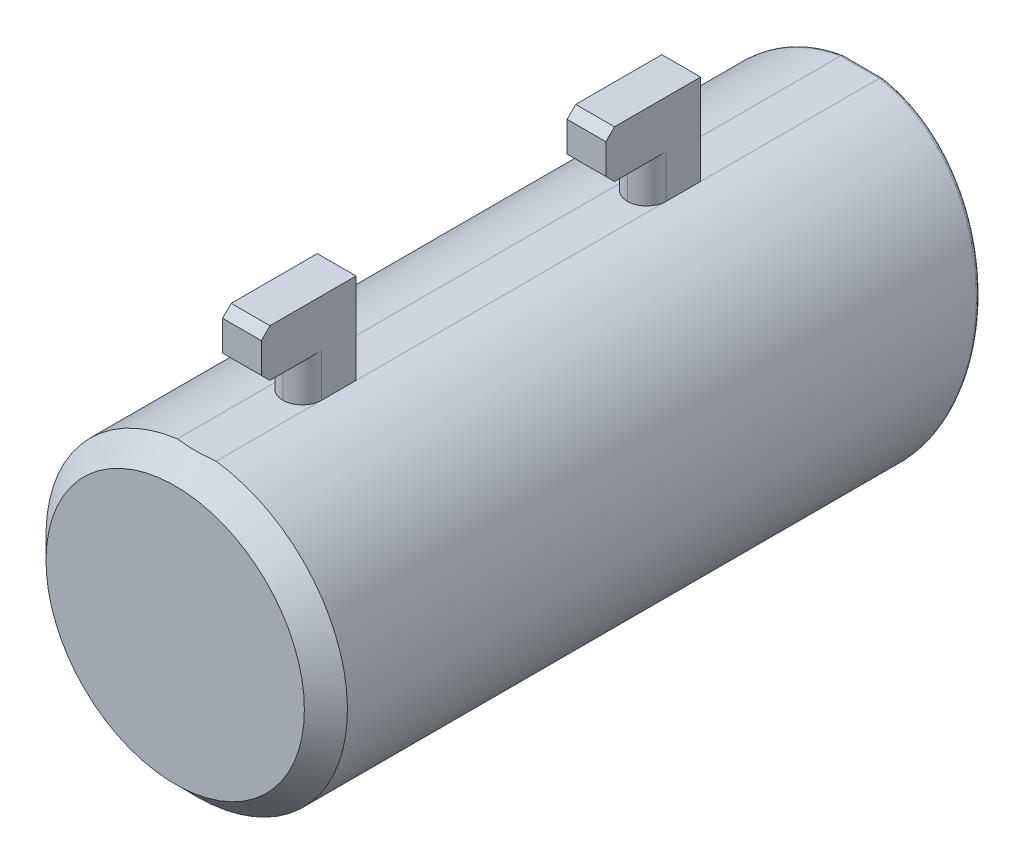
ISO-10303-21;
HEADER;
FILE_DESCRIPTION(('STEP AP214'),'2;1');
FILE_NAME('part.step','',(''),(''),'','','');
FILE_SCHEMA(('AUTOMOTIVE_DESIGN { 1 0 10303 214 1 1 1 1 }'));
ENDSEC;
DATA;
#1=APPLICATION_CONTEXT('core data for automotive mechanical design processes');
#2=APPLICATION_PROTOCOL_DEFINITION('international standard','automotive_design',2000,#1);
#3=PRODUCT_CONTEXT('',#1,'mechanical');
#4=PRODUCT('Part','Part','',(#3));
#5=PRODUCT_RELATED_PRODUCT_CATEGORY('part','',(#4));
#6=PRODUCT_DEFINITION_FORMATION('','',#4);
#7=PRODUCT_DEFINITION_CONTEXT('part definition',#1,'design');
#8=PRODUCT_DEFINITION('design','',#6,#7);
#9=PRODUCT_DEFINITION_SHAPE('','',#8);
#10=(LENGTH_UNIT() NAMED_UNIT(*) SI_UNIT(.MILLI.,.METRE.));
#11=(NAMED_UNIT(*) PLANE_ANGLE_UNIT() SI_UNIT($,.RADIAN.));
#12=(NAMED_UNIT(*) SI_UNIT($,.STERADIAN.) SOLID_ANGLE_UNIT());
#13=UNCERTAINTY_MEASURE_WITH_UNIT(LENGTH_MEASURE(1.E-05),#10,'distance_accuracy_value','');
#14=(GEOMETRIC_REPRESENTATION_CONTEXT(3) GLOBAL_UNCERTAINTY_ASSIGNED_CONTEXT((#13)) GLOBAL_UNIT_ASSIGNED_CONTEXT((#10,
#11,#12)) REPRESENTATION_CONTEXT('',''));
#15=CARTESIAN_POINT('',(0.,0.,0.));
#16=DIRECTION('',(0.,0.,1.));
#17=DIRECTION('',(1.,0.,0.));
#18=AXIS2_PLACEMENT_3D('',#15,#16,#17);
#19=CARTESIAN_POINT('',(-2.25,17.3547543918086,-84.5023434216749));
#20=DIRECTION('',(0.,-1.,0.));
#21=DIRECTION('',(0.,0.,-1.));
#22=AXIS2_PLACEMENT_3D('',#19,#20,#21);
#23=PLANE('',#22);
#24=DIRECTION('',(-1.,0.,0.));
#25=VECTOR('',#24,1.);
#26=CARTESIAN_POINT('',(2.25,17.3547543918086,-59.75));
#27=LINE('',#26,#25);
#28=CARTESIAN_POINT('',(1.25000000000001,17.3547543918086,-59.75));
#29=VERTEX_POINT('',#28);
#30=CARTESIAN_POINT('',(-1.25000000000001,17.3547543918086,-59.75));
#31=VERTEX_POINT('',#30);
#32=EDGE_CURVE('E360',#29,#31,#27,.T.);
#33=ORIENTED_EDGE('',*,*,#32,.F.);
#34=DIRECTION('',(-0.707106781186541,0.,-0.707106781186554));
#35=VECTOR('',#34,1.);
#36=CARTESIAN_POINT('',(-12.8761717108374,17.3547543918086,-73.8761717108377));
#37=LINE('',#36,#35);
#38=CARTESIAN_POINT('',(2.25,17.3547543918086,-58.75));
#39=VERTEX_POINT('',#38);
#40=EDGE_CURVE('E46',#29,#39,#37,.F.);
#41=ORIENTED_EDGE('',*,*,#40,.T.);
#42=DIRECTION('',(0.,0.,1.));
#43=VECTOR('',#42,1.);
#44=CARTESIAN_POINT('',(2.25,17.3547543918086,-84.5023434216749));
#45=LINE('',#44,#43);
#46=CARTESIAN_POINT('',(2.25,17.3547543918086,-79.4787098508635));
#47=VERTEX_POINT('',#46);
#48=EDGE_CURVE('E54',#47,#39,#45,.T.);
#49=ORIENTED_EDGE('',*,*,#48,.F.);
#50=DIRECTION('',(-1.,0.,0.));
#51=VECTOR('',#50,1.);
#52=CARTESIAN_POINT('',(-2.25,17.3547543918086,-79.4787098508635));
#53=LINE('',#52,#51);
#54=CARTESIAN_POINT('',(-2.25,17.3547543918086,-79.4787098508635));
#55=VERTEX_POINT('',#54);
#56=EDGE_CURVE('E487',#47,#55,#53,.T.);
#57=ORIENTED_EDGE('',*,*,#56,.T.);
#58=DIRECTION('',(0.,0.,1.));
#59=VECTOR('',#58,1.);
#60=CARTESIAN_POINT('',(-2.25,17.3547543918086,-84.5023434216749));
#61=LINE('',#60,#59);
#62=CARTESIAN_POINT('',(-2.25,17.3547543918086,-58.75));
#63=VERTEX_POINT('',#62);
#64=EDGE_CURVE('E440',#55,#63,#61,.T.);
#65=ORIENTED_EDGE('',*,*,#64,.T.);
#66=DIRECTION('',(0.707106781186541,0.,-0.707106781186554));
#67=VECTOR('',#66,1.);
#68=CARTESIAN_POINT('',(10.6261717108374,17.3547543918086,-71.6261717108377));
#69=LINE('',#68,#67);
#70=EDGE_CURVE('E11',#63,#31,#69,.T.);
#71=ORIENTED_EDGE('',*,*,#70,.T.);
#72=EDGE_LOOP('',(#33,#41,#49,#57,#65,#71));
#73=FACE_BOUND('',#72,.T.);
#74=ADVANCED_FACE('F35',(#73),#23,.F.);
#75=CARTESIAN_POINT('',(0.,17.3547543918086,-54.75));
#76=DIRECTION('',(0.,-1.,0.));
#77=DIRECTION('',(0.,0.,-1.));
#78=AXIS2_PLACEMENT_3D('',#75,#76,#77);
#79=CIRCLE('',#78,2.25);
#80=CARTESIAN_POINT('',(2.25,17.3547543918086,-54.75));
#81=VERTEX_POINT('',#80);
#82=CARTESIAN_POINT('',(0.,17.3547543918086,-52.5));
#83=VERTEX_POINT('',#82);
#84=EDGE_CURVE('E368',#81,#83,#79,.T.);
#85=ORIENTED_EDGE('',*,*,#84,.T.);
#86=CARTESIAN_POINT('',(0.,17.3547543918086,-54.75));
#87=DIRECTION('',(0.,-1.,0.));
#88=DIRECTION('',(0.,0.,-1.));
#89=AXIS2_PLACEMENT_3D('',#86,#87,#88);
#90=CIRCLE('',#89,2.25);
#91=CARTESIAN_POINT('',(-2.25,17.3547543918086,-54.75));
#92=VERTEX_POINT('',#91);
#93=EDGE_CURVE('E373',#83,#92,#90,.T.);
#94=ORIENTED_EDGE('',*,*,#93,.T.);
#95=CARTESIAN_POINT('',(-2.25,17.3547543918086,-18.75));
#96=VERTEX_POINT('',#95);
#97=EDGE_CURVE('E442',#92,#96,#61,.T.);
#98=ORIENTED_EDGE('',*,*,#97,.T.);
#99=DIRECTION('',(0.707106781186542,0.,-0.707106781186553));
#100=VECTOR('',#99,1.);
#101=CARTESIAN_POINT('',(30.6261717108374,17.3547543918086,-51.6261717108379));
#102=LINE('',#101,#100);
#103=CARTESIAN_POINT('',(-1.25000000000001,17.3547543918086,-19.75));
#104=VERTEX_POINT('',#103);
#105=EDGE_CURVE('E355',#96,#104,#102,.T.);
#106=ORIENTED_EDGE('',*,*,#105,.T.);
#107=DIRECTION('',(-1.,0.,0.));
#108=VECTOR('',#107,1.);
#109=CARTESIAN_POINT('',(2.25,17.3547543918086,-19.75));
#110=LINE('',#109,#108);
#111=CARTESIAN_POINT('',(1.25000000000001,17.3547543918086,-19.75));
#112=VERTEX_POINT('',#111);
#113=EDGE_CURVE('E283',#112,#104,#110,.T.);
#114=ORIENTED_EDGE('',*,*,#113,.F.);
#115=DIRECTION('',(-0.707106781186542,0.,-0.707106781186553));
#116=VECTOR('',#115,1.);
#117=CARTESIAN_POINT('',(-32.8761717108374,17.3547543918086,-53.8761717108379));
#118=LINE('',#117,#116);
#119=CARTESIAN_POINT('',(2.25,17.3547543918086,-18.75));
#120=VERTEX_POINT('',#119);
#121=EDGE_CURVE('E352',#112,#120,#118,.F.);
#122=ORIENTED_EDGE('',*,*,#121,.T.);
#123=EDGE_CURVE('E214',#81,#120,#45,.T.);
#124=ORIENTED_EDGE('',*,*,#123,.F.);
#125=EDGE_LOOP('',(#85,#94,#98,#106,#114,#122,#124));
#126=FACE_BOUND('',#125,.T.);
#127=ADVANCED_FACE('F250',(#126),#23,.F.);
#128=CARTESIAN_POINT('',(0.,17.3547543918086,-14.75));
#129=DIRECTION('',(0.,-1.,0.));
#130=DIRECTION('',(0.,0.,-1.));
#131=AXIS2_PLACEMENT_3D('',#128,#129,#130);
#132=CIRCLE('',#131,2.25);
#133=CARTESIAN_POINT('',(2.25,17.3547543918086,-14.75));
#134=VERTEX_POINT('',#133);
#135=CARTESIAN_POINT('',(0.,17.3547543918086,-12.5));
#136=VERTEX_POINT('',#135);
#137=EDGE_CURVE('E306',#134,#136,#132,.T.);
#138=ORIENTED_EDGE('',*,*,#137,.T.);
#139=CARTESIAN_POINT('',(0.,17.3547543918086,-14.75));
#140=DIRECTION('',(0.,-1.,0.));
#141=DIRECTION('',(0.,0.,-1.));
#142=AXIS2_PLACEMENT_3D('',#139,#140,#141);
#143=CIRCLE('',#142,2.25);
#144=CARTESIAN_POINT('',(-2.25,17.3547543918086,-14.75));
#145=VERTEX_POINT('',#144);
#146=EDGE_CURVE('E311',#136,#145,#143,.T.);
#147=ORIENTED_EDGE('',*,*,#146,.T.);
#148=CARTESIAN_POINT('',(-2.25,17.3547543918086,-2.50000000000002));
#149=VERTEX_POINT('',#148);
#150=EDGE_CURVE('E222',#145,#149,#61,.T.);
#151=ORIENTED_EDGE('',*,*,#150,.T.);
#152=CARTESIAN_POINT('',(-7.39801507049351,17.3547543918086,-3.86579250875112));
#153=CARTESIAN_POINT('',(-7.11525074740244,17.3547543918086,-3.75492178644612));
#154=CARTESIAN_POINT('',(-6.83068781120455,17.3547543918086,-3.64870430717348));
#155=CARTESIAN_POINT('',(-6.25782393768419,17.3547543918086,-3.44656681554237));
#156=CARTESIAN_POINT('',(-5.96952174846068,17.3547543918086,-3.35065035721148));
#157=CARTESIAN_POINT('',(-5.09778587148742,17.3547543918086,-3.07954499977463));
#158=CARTESIAN_POINT('',(-4.50879254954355,17.3547543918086,-2.92150746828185));
#159=CARTESIAN_POINT('',(-3.61896930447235,17.3547543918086,-2.72572777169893));
#160=CARTESIAN_POINT('',(-3.32253354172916,17.3547543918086,-2.66750269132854));
#161=CARTESIAN_POINT('',(-2.72723147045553,17.3547543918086,-2.56528965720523));
#162=CARTESIAN_POINT('',(-2.42836555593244,17.3547543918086,-2.52129944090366));
#163=CARTESIAN_POINT('',(-1.82909995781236,17.3547543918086,-2.44834471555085));
#164=CARTESIAN_POINT('',(-1.52870206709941,17.3547543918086,-2.41936550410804));
#165=CARTESIAN_POINT('',(-0.926807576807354,17.3547543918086,-2.37689187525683));
#166=CARTESIAN_POINT('',(-0.625310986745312,17.3547543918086,-2.36339732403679));
#167=CARTESIAN_POINT('',(-0.0338216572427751,17.3547543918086,-2.35236735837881));
#168=CARTESIAN_POINT('',(0.256159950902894,17.3547543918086,-2.35422857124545));
#169=CARTESIAN_POINT('',(0.835649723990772,17.3547543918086,-2.37244775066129));
#170=CARTESIAN_POINT('',(1.12515791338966,17.3547543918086,-2.3888049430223));
#171=CARTESIAN_POINT('',(1.70313704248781,17.3547543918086,-2.43574462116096));
#172=CARTESIAN_POINT('',(1.99160750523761,17.3547543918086,-2.46633297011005));
#173=CARTESIAN_POINT('',(2.56677619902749,17.3547543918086,-2.54122138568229));
#174=CARTESIAN_POINT('',(2.85347420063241,17.3547543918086,-2.5855231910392));
#175=CARTESIAN_POINT('',(3.70928843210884,17.3547543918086,-2.7378660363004));
#176=CARTESIAN_POINT('',(4.27500536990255,17.3547543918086,-2.86541956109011));
#177=CARTESIAN_POINT('',(5.39416092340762,17.3547543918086,-3.16571664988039));
#178=CARTESIAN_POINT('',(5.9475981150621,17.3547543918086,-3.33846542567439));
#179=CARTESIAN_POINT('',(6.6460151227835,17.3547543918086,-3.58324001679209));
#180=CARTESIAN_POINT('',(6.79726587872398,17.3547543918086,-3.6378843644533));
#181=CARTESIAN_POINT('',(7.09851532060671,17.3547543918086,-3.74985072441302));
#182=CARTESIAN_POINT('',(7.24851554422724,17.3547543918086,-3.80716859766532));
#183=CARTESIAN_POINT('',(7.39801507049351,17.3547543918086,-3.86579250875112));
#184=B_SPLINE_CURVE_WITH_KNOTS('',3,(#152,#153,#154,#155,#156,#157,#158,#159,#160,#161,#162,
#163,#164,#165,#166,#167,#168,#169,#170,#171,#172,#173,#174,#175,#176,#177,#178,#179,#180,#181,
#182,#183),.UNSPECIFIED.,.F.,.F.,(4,2,2,2,2,2,2,2,2,2,2,2,2,2,2,4),(0.,0.911061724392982,
1.82243677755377,3.64927911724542,4.55530452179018,5.46118584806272,6.36617823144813,
7.27116279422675,8.14076239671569,9.01031555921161,9.88022729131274,10.7502493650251,
12.4876529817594,14.2252570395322,14.7077005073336,15.1894203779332),.UNSPECIFIED.);
#185=CARTESIAN_POINT('',(2.25,17.3547543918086,-2.50000000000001));
#186=VERTEX_POINT('',#185);
#187=EDGE_CURVE('E219',#149,#186,#184,.T.);
#188=ORIENTED_EDGE('',*,*,#187,.T.);
#189=EDGE_CURVE('E205',#134,#186,#45,.T.);
#190=ORIENTED_EDGE('',*,*,#189,.F.);
#191=EDGE_LOOP('',(#138,#147,#151,#188,#190));
#192=FACE_BOUND('',#191,.T.);
#193=ADVANCED_FACE('F220',(#192),#23,.F.);
#194=CARTESIAN_POINT('',(0.,0.,-80.));
#195=DIRECTION('',(0.,0.,1.));
#196=DIRECTION('',(1.,0.,0.));
#197=AXIS2_PLACEMENT_3D('',#194,#195,#196);
#198=CYLINDRICAL_SURFACE('',#197,15.);
#199=CARTESIAN_POINT('',(0.,0.,-74.9356971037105));
#200=DIRECTION('',(0.,-0.26524119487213,-0.964182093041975));
#201=DIRECTION('',(0.,-0.964182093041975,0.26524119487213));
#202=AXIS2_PLACEMENT_3D('',#199,#200,#201);
#203=ELLIPSE('',#202,15.5572273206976,15.);
#204=CARTESIAN_POINT('',(0.,-15.,-70.8092795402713));
#205=VERTEX_POINT('',#204);
#206=EDGE_CURVE('E224',#205,#205,#203,.T.);
#207=ORIENTED_EDGE('',*,*,#206,.T.);
#208=EDGE_LOOP('',(#207));
#209=FACE_BOUND('',#208,.T.);
#210=CARTESIAN_POINT('',(0.,0.,-3.53553390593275));
#211=DIRECTION('',(0.,0.,-1.));
#212=DIRECTION('',(-1.,0.,0.));
#213=AXIS2_PLACEMENT_3D('',#210,#211,#212);
#214=CIRCLE('',#213,15.);
#215=CARTESIAN_POINT('',(-15.,0.,-3.53553390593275));
#216=VERTEX_POINT('',#215);
#217=EDGE_CURVE('E231',#216,#216,#214,.T.);
#218=ORIENTED_EDGE('',*,*,#217,.F.);
#219=EDGE_LOOP('',(#218));
#220=FACE_BOUND('',#219,.T.);
#221=ADVANCED_FACE('F255',(#209,#220),#198,.F.);
#222=CARTESIAN_POINT('',(0.,0.,-2.5));
#223=DIRECTION('',(0.,0.,1.));
#224=DIRECTION('',(1.,0.,0.));
#225=AXIS2_PLACEMENT_3D('',#222,#223,#224);
#226=PLANE('',#225);
#227=CARTESIAN_POINT('',(0.,0.,-2.5));
#228=DIRECTION('',(0.,0.,1.));
#229=DIRECTION('',(1.,0.,0.));
#230=AXIS2_PLACEMENT_3D('',#227,#228,#229);
#231=CIRCLE('',#230,13.9644660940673);
#232=CARTESIAN_POINT('',(13.9644660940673,0.,-2.5));
#233=VERTEX_POINT('',#232);
#234=EDGE_CURVE('E478',#233,#233,#231,.T.);
#235=ORIENTED_EDGE('',*,*,#234,.F.);
#236=EDGE_LOOP('',(#235));
#237=FACE_BOUND('',#236,.T.);
#238=ADVANCED_FACE('F259',(#237),#226,.F.);
#239=CARTESIAN_POINT('',(0.,0.,-1.76776695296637));
#240=DIRECTION('',(0.,0.,-1.));
#241=DIRECTION('',(-1.,0.,0.));
#242=AXIS2_PLACEMENT_3D('',#239,#240,#241);
#243=CONICAL_SURFACE('',#242,13.2322330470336,0.785398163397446);
#244=ORIENTED_EDGE('',*,*,#217,.T.);
#245=EDGE_LOOP('',(#244));
#246=FACE_BOUND('',#245,.T.);
#247=ORIENTED_EDGE('',*,*,#234,.T.);
#248=EDGE_LOOP('',(#247));
#249=FACE_BOUND('',#248,.T.);
#250=ADVANCED_FACE('F504',(#246,#249),#243,.F.);
#251=CARTESIAN_POINT('',(-17.5,-17.5,-70.66069670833));
#252=DIRECTION('',(0.,0.258819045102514,0.96592582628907));
#253=DIRECTION('',(0.,-0.96592582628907,0.258819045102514));
#254=AXIS2_PLACEMENT_3D('',#251,#252,#253);
#255=PLANE('',#254);
#256=CARTESIAN_POINT('',(0.,-0.103527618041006,-75.3220674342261));
#257=DIRECTION('',(0.,0.258819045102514,0.96592582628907));
#258=DIRECTION('',(0.,-0.96592582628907,0.258819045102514));
#259=AXIS2_PLACEMENT_3D('',#256,#257,#258);
#260=ELLIPSE('',#259,15.9432531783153,15.4);
#261=CARTESIAN_POINT('',(0.,-15.503527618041,-71.1956498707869));
#262=VERTEX_POINT('',#261);
#263=EDGE_CURVE('E488',#262,#262,#260,.T.);
#264=ORIENTED_EDGE('',*,*,#263,.T.);
#265=EDGE_LOOP('',(#264));
#266=FACE_BOUND('',#265,.T.);
#267=CARTESIAN_POINT('',(0.,-0.103527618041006,-75.3220674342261));
#268=DIRECTION('',(0.,0.258819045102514,0.96592582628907));
#269=DIRECTION('',(0.,-0.96592582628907,0.258819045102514));
#270=AXIS2_PLACEMENT_3D('',#267,#268,#269);
#271=ELLIPSE('',#270,17.7032226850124,17.1);
#272=CARTESIAN_POINT('',(2.22402866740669,16.8512267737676,-79.8650801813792));
#273=VERTEX_POINT('',#272);
#274=CARTESIAN_POINT('',(-2.22402866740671,16.8512267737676,-79.8650801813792));
#275=VERTEX_POINT('',#274);
#276=EDGE_CURVE('E494',#273,#275,#271,.F.);
#277=ORIENTED_EDGE('',*,*,#276,.T.);
#278=DIRECTION('',(-1.,0.,0.));
#279=VECTOR('',#278,1.);
#280=CARTESIAN_POINT('',(-17.5,16.8512267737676,-79.8650801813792));
#281=LINE('',#280,#279);
#282=EDGE_CURVE('E490',#275,#273,#281,.F.);
#283=ORIENTED_EDGE('',*,*,#282,.T.);
#284=EDGE_LOOP('',(#277,#283));
#285=FACE_BOUND('',#284,.T.);
#286=ADVANCED_FACE('F252',(#266,#285),#255,.F.);
#287=CARTESIAN_POINT('',(0.,0.,0.));
#288=DIRECTION('',(0.,0.,1.));
#289=DIRECTION('',(1.,0.,0.));
#290=AXIS2_PLACEMENT_3D('',#287,#288,#289);
#291=PLANE('',#290);
#292=CARTESIAN_POINT('',(0.,0.,0.));
#293=DIRECTION('',(0.,0.,1.));
#294=DIRECTION('',(1.,0.,0.));
#295=AXIS2_PLACEMENT_3D('',#292,#293,#294);
#296=CIRCLE('',#295,15.);
#297=CARTESIAN_POINT('',(15.,0.,0.));
#298=VERTEX_POINT('',#297);
#299=EDGE_CURVE('E228',#298,#298,#296,.T.);
#300=ORIENTED_EDGE('',*,*,#299,.T.);
#301=EDGE_LOOP('',(#300));
#302=FACE_BOUND('',#301,.T.);
#303=ADVANCED_FACE('F510',(#302),#291,.T.);
#304=CARTESIAN_POINT('',(0.,0.,0.));
#305=DIRECTION('',(0.,0.,-1.));
#306=DIRECTION('',(-1.,0.,0.));
#307=AXIS2_PLACEMENT_3D('',#304,#305,#306);
#308=CONICAL_SURFACE('',#307,15.,0.785398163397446);
#309=ORIENTED_EDGE('',*,*,#187,.F.);
#310=CARTESIAN_POINT('',(0.,0.,-2.50000000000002));
#311=DIRECTION('',(0.,0.,1.));
#312=DIRECTION('',(1.,0.,0.));
#313=AXIS2_PLACEMENT_3D('',#310,#311,#312);
#314=CIRCLE('',#313,17.5);
#315=EDGE_CURVE('E209',#186,#149,#314,.F.);
#316=ORIENTED_EDGE('',*,*,#315,.F.);
#317=EDGE_LOOP('',(#309,#316));
#318=FACE_BOUND('',#317,.T.);
#319=ORIENTED_EDGE('',*,*,#299,.F.);
#320=EDGE_LOOP('',(#319));
#321=FACE_BOUND('',#320,.T.);
#322=ADVANCED_FACE('F226',(#318,#321),#308,.T.);
#323=CARTESIAN_POINT('',(0.,0.,-80.));
#324=DIRECTION('',(0.,0.,1.));
#325=DIRECTION('',(1.,0.,0.));
#326=AXIS2_PLACEMENT_3D('',#323,#324,#325);
#327=CYLINDRICAL_SURFACE('',#326,17.5);
#328=CARTESIAN_POINT('',(-2.25,17.3547543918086,-79.4795994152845));
#329=VERTEX_POINT('',#328);
#330=EDGE_CURVE('E215',#329,#55,#61,.T.);
#331=ORIENTED_EDGE('',*,*,#330,.F.);
#332=CARTESIAN_POINT('',(0.,0.,-74.9356971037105));
#333=DIRECTION('',(0.,-0.253286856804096,-0.967391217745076));
#334=DIRECTION('',(0.,-0.967391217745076,0.253286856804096));
#335=AXIS2_PLACEMENT_3D('',#332,#333,#334);
#336=ELLIPSE('',#335,18.0898892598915,17.5);
#337=CARTESIAN_POINT('',(2.25,17.3547543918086,-79.4795994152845));
#338=VERTEX_POINT('',#337);
#339=EDGE_CURVE('E274',#329,#338,#336,.F.);
#340=ORIENTED_EDGE('',*,*,#339,.T.);
#341=EDGE_CURVE('E217',#338,#47,#45,.T.);
#342=ORIENTED_EDGE('',*,*,#341,.T.);
#343=ORIENTED_EDGE('',*,*,#48,.T.);
#344=DIRECTION('',(0.,0.,-1.));
#345=VECTOR('',#344,1.);
#346=CARTESIAN_POINT('',(2.25,17.3547543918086,-59.75));
#347=LINE('',#346,#345);
#348=EDGE_CURVE('E455',#81,#39,#347,.T.);
#349=ORIENTED_EDGE('',*,*,#348,.F.);
#350=ORIENTED_EDGE('',*,*,#123,.T.);
#351=DIRECTION('',(0.,0.,-1.));
#352=VECTOR('',#351,1.);
#353=CARTESIAN_POINT('',(2.25,17.3547543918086,-19.75));
#354=LINE('',#353,#352);
#355=EDGE_CURVE('E211',#134,#120,#354,.T.);
#356=ORIENTED_EDGE('',*,*,#355,.F.);
#357=ORIENTED_EDGE('',*,*,#189,.T.);
#358=ORIENTED_EDGE('',*,*,#315,.T.);
#359=ORIENTED_EDGE('',*,*,#150,.F.);
#360=DIRECTION('',(0.,0.,-1.));
#361=VECTOR('',#360,1.);
#362=CARTESIAN_POINT('',(-2.25,17.3547543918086,-19.75));
#363=LINE('',#362,#361);
#364=EDGE_CURVE('E460',#145,#96,#363,.T.);
#365=ORIENTED_EDGE('',*,*,#364,.T.);
#366=ORIENTED_EDGE('',*,*,#97,.F.);
#367=DIRECTION('',(0.,0.,-1.));
#368=VECTOR('',#367,1.);
#369=CARTESIAN_POINT('',(-2.25,17.3547543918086,-59.75));
#370=LINE('',#369,#368);
#371=EDGE_CURVE('E436',#92,#63,#370,.T.);
#372=ORIENTED_EDGE('',*,*,#371,.T.);
#373=ORIENTED_EDGE('',*,*,#64,.F.);
#374=EDGE_LOOP('',(#331,#340,#342,#343,#349,#350,#356,#357,#358,#359,#365,#366,#372,#373));
#375=FACE_BOUND('',#374,.T.);
#376=ADVANCED_FACE('F207',(#375),#327,.T.);
#377=CARTESIAN_POINT('',(0.,-15.,-70.8092795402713));
#378=CARTESIAN_POINT('',(0.,-15.,-71.3305696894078));
#379=CARTESIAN_POINT('',(0.,-15.503527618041,-71.1956498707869));
#380=CARTESIAN_POINT('',(0.654630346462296,-15.,-70.8092795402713));
#381=CARTESIAN_POINT('',(0.648538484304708,-15.,-71.3305696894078));
#382=CARTESIAN_POINT('',(0.672087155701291,-15.503527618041,-71.1956498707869));
#383=CARTESIAN_POINT('',(1.30926069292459,-14.9570666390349,-70.8210902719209));
#384=CARTESIAN_POINT('',(1.29642860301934,-14.957956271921,-71.3418352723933));
#385=CARTESIAN_POINT('',(1.34417431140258,-15.4594493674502,-71.2074606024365));
#386=CARTESIAN_POINT('',(2.60731098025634,-14.7861757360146,-70.8681014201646));
#387=CARTESIAN_POINT('',(2.58281643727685,-14.7901996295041,-71.3867855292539));
#388=CARTESIAN_POINT('',(2.67683927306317,-15.2840013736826,-71.2544717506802));
#389=CARTESIAN_POINT('',(3.25071637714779,-14.6581152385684,-70.9033301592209));
#390=CARTESIAN_POINT('',(3.22005873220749,-14.6647159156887,-71.420408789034));
#391=CARTESIAN_POINT('',(3.33740214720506,-15.1525259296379,-71.2897004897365));
#392=CARTESIAN_POINT('',(4.51532888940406,-14.3192646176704,-70.9965461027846));
#393=CARTESIAN_POINT('',(4.47451148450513,-14.331813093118,-71.5096098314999));
#394=CARTESIAN_POINT('',(4.63573765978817,-14.8046392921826,-71.3829164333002));
#395=CARTESIAN_POINT('',(5.1364806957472,-14.1082821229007,-71.0545862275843));
#396=CARTESIAN_POINT('',(5.09058637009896,-14.1248317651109,-71.5650703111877));
#397=CARTESIAN_POINT('',(5.27345351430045,-14.5880305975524,-71.4409565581));
#398=CARTESIAN_POINT('',(6.34600474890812,-13.6072826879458,-71.1924084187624));
#399=CARTESIAN_POINT('',(6.29226234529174,-13.6319980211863,-71.6971247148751));
#400=CARTESIAN_POINT('',(6.51523154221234,-14.0736711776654,-71.578778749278));
#401=CARTESIAN_POINT('',(6.93426266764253,-13.3170085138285,-71.2722612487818));
#402=CARTESIAN_POINT('',(6.87691476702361,-13.3467535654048,-71.7735557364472));
#403=CARTESIAN_POINT('',(7.11917633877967,-13.7756563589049,-71.6586315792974));
#404=CARTESIAN_POINT('',(8.06799673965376,-12.6624491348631,-71.4523269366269));
#405=CARTESIAN_POINT('',(8.00566742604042,-12.7017886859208,-71.9463735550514));
#406=CARTESIAN_POINT('',(8.28314331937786,-13.1036420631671,-71.8386972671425));
#407=CARTESIAN_POINT('',(8.61329265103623,-12.297872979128,-71.5526198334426));
#408=CARTESIAN_POINT('',(8.54905612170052,-12.3427951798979,-72.0425655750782));
#409=CARTESIAN_POINT('',(8.84298045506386,-12.7293438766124,-71.9389901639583));
#410=CARTESIAN_POINT('',(9.65183938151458,-11.5009706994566,-71.771843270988));
#411=CARTESIAN_POINT('',(9.58574816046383,-11.5560339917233,-72.2533776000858));
#412=CARTESIAN_POINT('',(9.90922176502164,-11.9111908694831,-72.1582136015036));
#413=CARTESIAN_POINT('',(10.1448496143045,-11.0683523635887,-71.8908541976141));
#414=CARTESIAN_POINT('',(10.0786078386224,-11.1290540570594,-72.3677865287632));
#415=CARTESIAN_POINT('',(10.4153789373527,-11.4670360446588,-72.2772245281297));
#416=CARTESIAN_POINT('',(11.0704472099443,-10.1427576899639,-72.1454802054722));
#417=CARTESIAN_POINT('',(11.0054435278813,-10.213272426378,-72.6131694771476));
#418=CARTESIAN_POINT('',(11.3656591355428,-10.5167588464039,-72.5318505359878));
#419=CARTESIAN_POINT('',(11.5027505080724,-9.64951660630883,-72.2811681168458));
#420=CARTESIAN_POINT('',(11.439255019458,-9.72525994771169,-72.7439320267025));
#421=CARTESIAN_POINT('',(11.809490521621,-10.0103646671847,-72.6675384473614));
#422=CARTESIAN_POINT('',(12.2995750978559,-8.61107768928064,-72.566836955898));
#423=CARTESIAN_POINT('',(12.240118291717,-8.69552485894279,-73.0198487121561));
#424=CARTESIAN_POINT('',(12.6275637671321,-8.94423404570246,-72.9532072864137));
#425=CARTESIAN_POINT('',(12.6637940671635,-8.06566365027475,-72.716877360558));
#426=CARTESIAN_POINT('',(12.6072784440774,-8.15453690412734,-73.1648059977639));
#427=CARTESIAN_POINT('',(13.0014952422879,-8.38427563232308,-73.1032476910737));
#428=CARTESIAN_POINT('',(13.3182282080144,-6.93215369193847,-73.0286997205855));
#429=CARTESIAN_POINT('',(13.2680601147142,-7.02799573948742,-73.4666617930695));
#430=CARTESIAN_POINT('',(13.6733809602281,-7.22053874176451,-73.4150700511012));
#431=CARTESIAN_POINT('',(13.6081524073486,-6.34390120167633,-73.1905247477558));
#432=CARTESIAN_POINT('',(13.5620421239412,-6.44307299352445,-73.6233913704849));
#433=CARTESIAN_POINT('',(13.9710364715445,-6.6165995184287,-73.5768950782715));
#434=CARTESIAN_POINT('',(14.1090155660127,-5.13471386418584,-73.5231655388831));
#435=CARTESIAN_POINT('',(14.0709393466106,-5.23868395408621,-73.9461064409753));
#436=CARTESIAN_POINT('',(14.4852559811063,-5.3751671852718,-73.9095358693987));
#437=CARTESIAN_POINT('',(14.3197046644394,-4.51368255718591,-73.6940078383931));
#438=CARTESIAN_POINT('',(14.2864350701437,-4.61970239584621,-74.1119620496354));
#439=CARTESIAN_POINT('',(14.7015634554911,-4.73757504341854,-74.0803781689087));
#440=CARTESIAN_POINT('',(14.6584421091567,-3.24950053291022,-74.0417773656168));
#441=CARTESIAN_POINT('',(14.6342086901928,-3.3579134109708,-74.4500573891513));
#442=CARTESIAN_POINT('',(15.0493338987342,-3.4396814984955,-74.4281476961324));
#443=CARTESIAN_POINT('',(14.7863077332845,-2.60630418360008,-74.2187171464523));
#444=CARTESIAN_POINT('',(14.7672464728,-2.71541226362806,-74.6222150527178));
#445=CARTESIAN_POINT('',(15.1806092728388,-2.77933324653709,-74.605087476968));
#446=CARTESIAN_POINT('',(14.9571348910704,-1.30874644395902,-74.5756681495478));
#447=CARTESIAN_POINT('',(14.9474259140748,-1.41779901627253,-74.9699094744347));
#448=CARTESIAN_POINT('',(15.355991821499,-1.44717396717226,-74.9620384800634));
#449=CARTESIAN_POINT('',(15.,-0.654373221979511,-74.7556826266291));
#450=CARTESIAN_POINT('',(14.9954597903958,-0.762791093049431,-75.1454183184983));
#451=CARTESIAN_POINT('',(15.4,-0.775350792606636,-75.1420529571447));
#452=CARTESIAN_POINT('',(15.,0.654373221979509,-75.1157115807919));
#453=CARTESIAN_POINT('',(15.004489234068,0.54833392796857,-75.4967332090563));
#454=CARTESIAN_POINT('',(15.4,0.568295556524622,-75.5020819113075));
#455=CARTESIAN_POINT('',(14.9571348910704,1.30874644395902,-75.2957260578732));
#456=CARTESIAN_POINT('',(14.9664574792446,1.20456322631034,-75.6725693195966));
#457=CARTESIAN_POINT('',(15.355991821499,1.24011873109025,-75.6820963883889));
#458=CARTESIAN_POINT('',(14.7863077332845,2.60630418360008,-75.6526770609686));
#459=CARTESIAN_POINT('',(14.8037806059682,2.50655888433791,-76.0214380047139));
#460=CARTESIAN_POINT('',(15.1806092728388,2.57227801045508,-76.0390473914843));
#461=CARTESIAN_POINT('',(14.6584421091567,3.24950053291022,-75.8296168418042));
#462=CARTESIAN_POINT('',(14.680133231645,3.15265811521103,-76.1945597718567));
#463=CARTESIAN_POINT('',(15.0493338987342,3.23262626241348,-76.2159871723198));
#464=CARTESIAN_POINT('',(14.3197046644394,4.5136825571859,-76.1773863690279));
#465=CARTESIAN_POINT('',(14.3482164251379,4.42296917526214,-76.5349385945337));
#466=CARTESIAN_POINT('',(14.7015634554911,4.53051980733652,-76.5637566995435));
#467=CARTESIAN_POINT('',(14.1090155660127,5.13471386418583,-76.3482286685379));
#468=CARTESIAN_POINT('',(14.1409123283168,5.04772785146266,-76.702342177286));
#469=CARTESIAN_POINT('',(14.4852559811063,5.16811194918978,-76.7345989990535));
#470=CARTESIAN_POINT('',(13.6081524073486,6.34390120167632,-76.6808694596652));
#471=CARTESIAN_POINT('',(13.645208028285,6.26429634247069,-77.0283207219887));
#472=CARTESIAN_POINT('',(13.9710364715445,6.40954428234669,-77.0672397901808));
#473=CARTESIAN_POINT('',(13.3182282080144,6.93215369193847,-76.8426944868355));
#474=CARTESIAN_POINT('',(13.3576831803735,6.85684804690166,-77.1870944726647));
#475=CARTESIAN_POINT('',(13.6733809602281,7.01348350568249,-77.2290648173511));
#476=CARTESIAN_POINT('',(12.6637940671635,8.06566365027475,-77.1545168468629));
#477=CARTESIAN_POINT('',(12.7065362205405,7.99851308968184,-77.4930026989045));
#478=CARTESIAN_POINT('',(13.0014952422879,8.17722039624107,-77.5408871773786));
#479=CARTESIAN_POINT('',(12.2995750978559,8.61107768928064,-77.304557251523));
#480=CARTESIAN_POINT('',(12.3436446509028,8.54853105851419,-77.6403795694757));
#481=CARTESIAN_POINT('',(12.6275637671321,8.73717880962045,-77.6909275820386));
#482=CARTESIAN_POINT('',(11.5027505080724,9.64951660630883,-77.5902260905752));
#483=CARTESIAN_POINT('',(11.5481451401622,9.59540989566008,-77.9208899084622));
#484=CARTESIAN_POINT('',(11.809490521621,9.80330943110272,-77.9765964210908));
#485=CARTESIAN_POINT('',(11.0704472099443,10.1427576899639,-77.7259140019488));
#486=CARTESIAN_POINT('',(11.1160746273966,10.0932919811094,-78.0542970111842));
#487=CARTESIAN_POINT('',(11.3656591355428,10.3097036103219,-78.1122843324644));
#488=CARTESIAN_POINT('',(10.1448496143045,11.0683523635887,-77.9805400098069));
#489=CARTESIAN_POINT('',(10.1898614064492,11.027135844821,-78.3045197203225));
#490=CARTESIAN_POINT('',(10.4153789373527,11.2599808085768,-78.3669103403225));
#491=CARTESIAN_POINT('',(9.65183938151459,11.5009706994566,-78.099550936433));
#492=CARTESIAN_POINT('',(9.69602582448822,11.4641761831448,-78.4216243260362));
#493=CARTESIAN_POINT('',(9.90922176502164,11.7041356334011,-78.4859212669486));
#494=CARTESIAN_POINT('',(8.61329265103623,12.297872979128,-78.3187743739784));
#495=CARTESIAN_POINT('',(8.65504488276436,12.2686953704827,-78.6371945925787));
#496=CARTESIAN_POINT('',(8.84298045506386,12.5222886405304,-78.705144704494));
#497=CARTESIAN_POINT('',(8.06799673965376,12.6624491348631,-78.4190672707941));
#498=CARTESIAN_POINT('',(8.10795513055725,12.6372403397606,-78.7359459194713));
#499=CARTESIAN_POINT('',(8.28314331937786,12.8965868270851,-78.8054376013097));
#500=CARTESIAN_POINT('',(6.93426266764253,13.3170085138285,-78.5991329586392));
#501=CARTESIAN_POINT('',(6.97017768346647,13.2983934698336,-78.9131013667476));
#502=CARTESIAN_POINT('',(7.11917633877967,13.5686011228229,-78.9855032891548));
#503=CARTESIAN_POINT('',(6.34600474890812,13.6072826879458,-78.6789857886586));
#504=CARTESIAN_POINT('',(6.37929313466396,13.5919796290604,-78.9917675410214));
#505=CARTESIAN_POINT('',(6.51523154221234,13.8666159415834,-79.0653561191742));
#506=CARTESIAN_POINT('',(5.1364806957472,14.1082821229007,-78.8168079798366));
#507=CARTESIAN_POINT('',(5.16439839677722,14.0982225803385,-79.1274149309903));
#508=CARTESIAN_POINT('',(5.27345351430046,14.3809753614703,-79.2031783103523));
#509=CARTESIAN_POINT('',(4.51532888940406,14.3192646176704,-78.8748481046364));
#510=CARTESIAN_POINT('',(4.53996092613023,14.3116942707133,-79.1846144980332));
#511=CARTESIAN_POINT('',(4.63573765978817,14.5975840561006,-79.261218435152));
#512=CARTESIAN_POINT('',(3.25071637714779,14.6581152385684,-78.9680640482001));
#513=CARTESIAN_POINT('',(3.26898900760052,14.654184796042,-79.2763845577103));
#514=CARTESIAN_POINT('',(3.33740214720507,14.9454706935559,-79.3544343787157));
#515=CARTESIAN_POINT('',(2.60731098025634,14.7861757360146,-79.0032927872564));
#516=CARTESIAN_POINT('',(2.62184195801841,14.783789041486,-79.3111119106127));
#517=CARTESIAN_POINT('',(2.67683927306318,15.0769461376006,-79.389663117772));
#518=CARTESIAN_POINT('',(1.3092606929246,14.9570666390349,-79.0503039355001));
#519=CARTESIAN_POINT('',(1.31682276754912,14.9565436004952,-79.357401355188));
#520=CARTESIAN_POINT('',(1.34417431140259,15.2523941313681,-79.4366742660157));
#521=CARTESIAN_POINT('',(0.654630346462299,15.,-79.0621146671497));
#522=CARTESIAN_POINT('',(0.658217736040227,15.,-79.3690454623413));
#523=CARTESIAN_POINT('',(0.672087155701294,15.296472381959,-79.4484849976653));
#524=CARTESIAN_POINT('',(-0.654630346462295,15.,-79.0621146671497));
#525=CARTESIAN_POINT('',(-0.658217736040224,15.,-79.3690454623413));
#526=CARTESIAN_POINT('',(-0.67208715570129,15.296472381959,-79.4484849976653));
#527=CARTESIAN_POINT('',(-1.30926069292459,14.9570666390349,-79.0503039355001));
#528=CARTESIAN_POINT('',(-1.31682276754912,14.9565436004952,-79.357401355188));
#529=CARTESIAN_POINT('',(-1.34417431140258,15.2523941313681,-79.4366742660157));
#530=CARTESIAN_POINT('',(-2.60731098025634,14.7861757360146,-79.0032927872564));
#531=CARTESIAN_POINT('',(-2.62184195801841,14.783789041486,-79.3111119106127));
#532=CARTESIAN_POINT('',(-2.67683927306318,15.0769461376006,-79.389663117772));
#533=CARTESIAN_POINT('',(-3.25071637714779,14.6581152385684,-78.9680640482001));
#534=CARTESIAN_POINT('',(-3.26898900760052,14.654184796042,-79.2763845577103));
#535=CARTESIAN_POINT('',(-3.33740214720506,14.9454706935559,-79.3544343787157));
#536=CARTESIAN_POINT('',(-4.51532888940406,14.3192646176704,-78.8748481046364));
#537=CARTESIAN_POINT('',(-4.53996092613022,14.3116942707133,-79.1846144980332));
#538=CARTESIAN_POINT('',(-4.63573765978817,14.5975840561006,-79.261218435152));
#539=CARTESIAN_POINT('',(-5.1364806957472,14.1082821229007,-78.8168079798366));
#540=CARTESIAN_POINT('',(-5.16439839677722,14.0982225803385,-79.1274149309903));
#541=CARTESIAN_POINT('',(-5.27345351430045,14.3809753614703,-79.2031783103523));
#542=CARTESIAN_POINT('',(-6.34600474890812,13.6072826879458,-78.6789857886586));
#543=CARTESIAN_POINT('',(-6.37929313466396,13.5919796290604,-78.9917675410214));
#544=CARTESIAN_POINT('',(-6.51523154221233,13.8666159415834,-79.0653561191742));
#545=CARTESIAN_POINT('',(-6.93426266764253,13.3170085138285,-78.5991329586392));
#546=CARTESIAN_POINT('',(-6.97017768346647,13.2983934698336,-78.9131013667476));
#547=CARTESIAN_POINT('',(-7.11917633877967,13.5686011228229,-78.9855032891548));
#548=CARTESIAN_POINT('',(-8.06799673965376,12.6624491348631,-78.4190672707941));
#549=CARTESIAN_POINT('',(-8.10795513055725,12.6372403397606,-78.7359459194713));
#550=CARTESIAN_POINT('',(-8.28314331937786,12.8965868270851,-78.8054376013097));
#551=CARTESIAN_POINT('',(-8.61329265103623,12.297872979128,-78.3187743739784));
#552=CARTESIAN_POINT('',(-8.65504488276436,12.2686953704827,-78.6371945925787));
#553=CARTESIAN_POINT('',(-8.84298045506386,12.5222886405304,-78.705144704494));
#554=CARTESIAN_POINT('',(-9.65183938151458,11.5009706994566,-78.099550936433));
#555=CARTESIAN_POINT('',(-9.69602582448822,11.4641761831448,-78.4216243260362));
#556=CARTESIAN_POINT('',(-9.90922176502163,11.7041356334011,-78.4859212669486));
#557=CARTESIAN_POINT('',(-10.1448496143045,11.0683523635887,-77.9805400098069));
#558=CARTESIAN_POINT('',(-10.1898614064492,11.027135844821,-78.3045197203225));
#559=CARTESIAN_POINT('',(-10.4153789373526,11.2599808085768,-78.3669103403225));
#560=CARTESIAN_POINT('',(-11.0704472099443,10.1427576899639,-77.7259140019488));
#561=CARTESIAN_POINT('',(-11.1160746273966,10.0932919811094,-78.0542970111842));
#562=CARTESIAN_POINT('',(-11.3656591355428,10.3097036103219,-78.1122843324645));
#563=CARTESIAN_POINT('',(-11.5027505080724,9.64951660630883,-77.5902260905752));
#564=CARTESIAN_POINT('',(-11.5481451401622,9.59540989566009,-77.9208899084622));
#565=CARTESIAN_POINT('',(-11.809490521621,9.80330943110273,-77.9765964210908));
#566=CARTESIAN_POINT('',(-12.2995750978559,8.61107768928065,-77.304557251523));
#567=CARTESIAN_POINT('',(-12.3436446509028,8.5485310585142,-77.6403795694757));
#568=CARTESIAN_POINT('',(-12.6275637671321,8.73717880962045,-77.6909275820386));
#569=CARTESIAN_POINT('',(-12.6637940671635,8.06566365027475,-77.1545168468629));
#570=CARTESIAN_POINT('',(-12.7065362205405,7.99851308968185,-77.4930026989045));
#571=CARTESIAN_POINT('',(-13.0014952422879,8.17722039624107,-77.5408871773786));
#572=CARTESIAN_POINT('',(-13.3182282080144,6.93215369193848,-76.8426944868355));
#573=CARTESIAN_POINT('',(-13.3576831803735,6.85684804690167,-77.1870944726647));
#574=CARTESIAN_POINT('',(-13.6733809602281,7.0134835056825,-77.2290648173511));
#575=CARTESIAN_POINT('',(-13.6081524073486,6.34390120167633,-76.6808694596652));
#576=CARTESIAN_POINT('',(-13.645208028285,6.2642963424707,-77.0283207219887));
#577=CARTESIAN_POINT('',(-13.9710364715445,6.40954428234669,-77.0672397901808));
#578=CARTESIAN_POINT('',(-14.1090155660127,5.13471386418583,-76.3482286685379));
#579=CARTESIAN_POINT('',(-14.1409123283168,5.04772785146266,-76.702342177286));
#580=CARTESIAN_POINT('',(-14.4852559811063,5.16811194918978,-76.7345989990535));
#581=CARTESIAN_POINT('',(-14.3197046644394,4.5136825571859,-76.1773863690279));
#582=CARTESIAN_POINT('',(-14.3482164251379,4.42296917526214,-76.5349385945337));
#583=CARTESIAN_POINT('',(-14.7015634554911,4.53051980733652,-76.5637566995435));
#584=CARTESIAN_POINT('',(-14.6584421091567,3.24950053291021,-75.8296168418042));
#585=CARTESIAN_POINT('',(-14.680133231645,3.15265811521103,-76.1945597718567));
#586=CARTESIAN_POINT('',(-15.0493338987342,3.23262626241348,-76.2159871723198));
#587=CARTESIAN_POINT('',(-14.7863077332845,2.60630418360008,-75.6526770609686));
#588=CARTESIAN_POINT('',(-14.8037806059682,2.50655888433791,-76.0214380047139));
#589=CARTESIAN_POINT('',(-15.1806092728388,2.57227801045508,-76.0390473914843));
#590=CARTESIAN_POINT('',(-14.9571348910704,1.30874644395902,-75.2957260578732));
#591=CARTESIAN_POINT('',(-14.9664574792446,1.20456322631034,-75.6725693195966));
#592=CARTESIAN_POINT('',(-15.355991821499,1.24011873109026,-75.6820963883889));
#593=CARTESIAN_POINT('',(-15.,0.654373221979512,-75.1157115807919));
#594=CARTESIAN_POINT('',(-15.004489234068,0.548333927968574,-75.4967332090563));
#595=CARTESIAN_POINT('',(-15.4,0.568295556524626,-75.5020819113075));
#596=CARTESIAN_POINT('',(-15.,-0.654373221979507,-74.7556826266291));
#597=CARTESIAN_POINT('',(-14.9954597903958,-0.762791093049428,-75.1454183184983));
#598=CARTESIAN_POINT('',(-15.4,-0.775350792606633,-75.1420529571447));
#599=CARTESIAN_POINT('',(-14.9571348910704,-1.30874644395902,-74.5756681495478));
#600=CARTESIAN_POINT('',(-14.9474259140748,-1.41779901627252,-74.9699094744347));
#601=CARTESIAN_POINT('',(-15.355991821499,-1.44717396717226,-74.9620384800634));
#602=CARTESIAN_POINT('',(-14.7863077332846,-2.60630418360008,-74.2187171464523));
#603=CARTESIAN_POINT('',(-14.7672464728,-2.71541226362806,-74.6222150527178));
#604=CARTESIAN_POINT('',(-15.1806092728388,-2.77933324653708,-74.605087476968));
#605=CARTESIAN_POINT('',(-14.6584421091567,-3.24950053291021,-74.0417773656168));
#606=CARTESIAN_POINT('',(-14.6342086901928,-3.35791341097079,-74.4500573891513));
#607=CARTESIAN_POINT('',(-15.0493338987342,-3.43968149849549,-74.4281476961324));
#608=CARTESIAN_POINT('',(-14.3197046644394,-4.5136825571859,-73.6940078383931));
#609=CARTESIAN_POINT('',(-14.2864350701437,-4.6197023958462,-74.1119620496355));
#610=CARTESIAN_POINT('',(-14.7015634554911,-4.73757504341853,-74.0803781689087));
#611=CARTESIAN_POINT('',(-14.1090155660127,-5.13471386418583,-73.5231655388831));
#612=CARTESIAN_POINT('',(-14.0709393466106,-5.2386839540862,-73.9461064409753));
#613=CARTESIAN_POINT('',(-14.4852559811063,-5.37516718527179,-73.9095358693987));
#614=CARTESIAN_POINT('',(-13.6081524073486,-6.34390120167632,-73.1905247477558));
#615=CARTESIAN_POINT('',(-13.5620421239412,-6.44307299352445,-73.6233913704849));
#616=CARTESIAN_POINT('',(-13.9710364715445,-6.61659951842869,-73.5768950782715));
#617=CARTESIAN_POINT('',(-13.3182282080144,-6.93215369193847,-73.0286997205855));
#618=CARTESIAN_POINT('',(-13.2680601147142,-7.02799573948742,-73.4666617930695));
#619=CARTESIAN_POINT('',(-13.6733809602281,-7.2205387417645,-73.4150700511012));
#620=CARTESIAN_POINT('',(-12.6637940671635,-8.06566365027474,-72.716877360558));
#621=CARTESIAN_POINT('',(-12.6072784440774,-8.15453690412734,-73.1648059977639));
#622=CARTESIAN_POINT('',(-13.0014952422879,-8.38427563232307,-73.1032476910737));
#623=CARTESIAN_POINT('',(-12.2995750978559,-8.61107768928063,-72.566836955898));
#624=CARTESIAN_POINT('',(-12.240118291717,-8.69552485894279,-73.0198487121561));
#625=CARTESIAN_POINT('',(-12.6275637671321,-8.94423404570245,-72.9532072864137));
#626=CARTESIAN_POINT('',(-11.5027505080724,-9.64951660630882,-72.2811681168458));
#627=CARTESIAN_POINT('',(-11.439255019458,-9.72525994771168,-72.7439320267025));
#628=CARTESIAN_POINT('',(-11.809490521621,-10.0103646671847,-72.6675384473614));
#629=CARTESIAN_POINT('',(-11.0704472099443,-10.1427576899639,-72.1454802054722));
#630=CARTESIAN_POINT('',(-11.0054435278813,-10.213272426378,-72.6131694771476));
#631=CARTESIAN_POINT('',(-11.3656591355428,-10.5167588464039,-72.5318505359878));
#632=CARTESIAN_POINT('',(-10.1448496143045,-11.0683523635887,-71.8908541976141));
#633=CARTESIAN_POINT('',(-10.0786078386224,-11.1290540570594,-72.3677865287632));
#634=CARTESIAN_POINT('',(-10.4153789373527,-11.4670360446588,-72.2772245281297));
#635=CARTESIAN_POINT('',(-9.65183938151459,-11.5009706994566,-71.771843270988));
#636=CARTESIAN_POINT('',(-9.58574816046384,-11.5560339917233,-72.2533776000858));
#637=CARTESIAN_POINT('',(-9.90922176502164,-11.9111908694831,-72.1582136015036));
#638=CARTESIAN_POINT('',(-8.61329265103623,-12.297872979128,-71.5526198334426));
#639=CARTESIAN_POINT('',(-8.54905612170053,-12.3427951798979,-72.0425655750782));
#640=CARTESIAN_POINT('',(-8.84298045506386,-12.7293438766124,-71.9389901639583));
#641=CARTESIAN_POINT('',(-8.06799673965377,-12.6624491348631,-71.4523269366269));
#642=CARTESIAN_POINT('',(-8.00566742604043,-12.7017886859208,-71.9463735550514));
#643=CARTESIAN_POINT('',(-8.28314331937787,-13.1036420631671,-71.8386972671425));
#644=CARTESIAN_POINT('',(-6.93426266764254,-13.3170085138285,-71.2722612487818));
#645=CARTESIAN_POINT('',(-6.87691476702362,-13.3467535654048,-71.7735557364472));
#646=CARTESIAN_POINT('',(-7.11917633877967,-13.7756563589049,-71.6586315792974));
#647=CARTESIAN_POINT('',(-6.34600474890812,-13.6072826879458,-71.1924084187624));
#648=CARTESIAN_POINT('',(-6.29226234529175,-13.6319980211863,-71.6971247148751));
#649=CARTESIAN_POINT('',(-6.51523154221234,-14.0736711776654,-71.578778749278));
#650=CARTESIAN_POINT('',(-5.1364806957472,-14.1082821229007,-71.0545862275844));
#651=CARTESIAN_POINT('',(-5.09058637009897,-14.1248317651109,-71.5650703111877));
#652=CARTESIAN_POINT('',(-5.27345351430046,-14.5880305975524,-71.4409565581));
#653=CARTESIAN_POINT('',(-4.51532888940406,-14.3192646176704,-70.9965461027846));
#654=CARTESIAN_POINT('',(-4.47451148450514,-14.331813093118,-71.5096098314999));
#655=CARTESIAN_POINT('',(-4.63573765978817,-14.8046392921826,-71.3829164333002));
#656=CARTESIAN_POINT('',(-3.25071637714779,-14.6581152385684,-70.9033301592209));
#657=CARTESIAN_POINT('',(-3.2200587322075,-14.6647159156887,-71.420408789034));
#658=CARTESIAN_POINT('',(-3.33740214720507,-15.1525259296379,-71.2897004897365));
#659=CARTESIAN_POINT('',(-2.60731098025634,-14.7861757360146,-70.8681014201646));
#660=CARTESIAN_POINT('',(-2.58281643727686,-14.7901996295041,-71.3867855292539));
#661=CARTESIAN_POINT('',(-2.67683927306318,-15.2840013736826,-71.2544717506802));
#662=CARTESIAN_POINT('',(-1.30926069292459,-14.9570666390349,-70.8210902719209));
#663=CARTESIAN_POINT('',(-1.29642860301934,-14.957956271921,-71.3418352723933));
#664=CARTESIAN_POINT('',(-1.34417431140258,-15.4594493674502,-71.2074606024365));
#665=CARTESIAN_POINT('',(-0.654630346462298,-15.,-70.8092795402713));
#666=CARTESIAN_POINT('',(-0.64853848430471,-15.,-71.3305696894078));
#667=CARTESIAN_POINT('',(-0.672087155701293,-15.503527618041,-71.1956498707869));
#668=CARTESIAN_POINT('',(0.,-15.,-70.8092795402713));
#669=CARTESIAN_POINT('',(0.,-15.,-71.3305696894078));
#670=CARTESIAN_POINT('',(0.,-15.503527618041,-71.1956498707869));
#671=(BOUNDED_SURFACE() B_SPLINE_SURFACE(3,2,((#377,#378,#379),(#380,#381,#382),(#383,#384,
#385),(#386,#387,#388),(#389,#390,#391),(#392,#393,#394),(#395,#396,#397),(#398,#399,#400),
(#401,#402,#403),(#404,#405,#406),(#407,#408,#409),(#410,#411,#412),(#413,#414,#415),(#416,#417,
#418),(#419,#420,#421),(#422,#423,#424),(#425,#426,#427),(#428,#429,#430),(#431,#432,#433),
(#434,#435,#436),(#437,#438,#439),(#440,#441,#442),(#443,#444,#445),(#446,#447,#448),(#449,#450,
#451),(#452,#453,#454),(#455,#456,#457),(#458,#459,#460),(#461,#462,#463),(#464,#465,#466),
(#467,#468,#469),(#470,#471,#472),(#473,#474,#475),(#476,#477,#478),(#479,#480,#481),(#482,#483,
#484),(#485,#486,#487),(#488,#489,#490),(#491,#492,#493),(#494,#495,#496),(#497,#498,#499),
(#500,#501,#502),(#503,#504,#505),(#506,#507,#508),(#509,#510,#511),(#512,#513,#514),(#515,#516,
#517),(#518,#519,#520),(#521,#522,#523),(#524,#525,#526),(#527,#528,#529),(#530,#531,#532),
(#533,#534,#535),(#536,#537,#538),(#539,#540,#541),(#542,#543,#544),(#545,#546,#547),(#548,#549,
#550),(#551,#552,#553),(#554,#555,#556),(#557,#558,#559),(#560,#561,#562),(#563,#564,#565),
(#566,#567,#568),(#569,#570,#571),(#572,#573,#574),(#575,#576,#577),(#578,#579,#580),(#581,#582,
#583),(#584,#585,#586),(#587,#588,#589),(#590,#591,#592),(#593,#594,#595),(#596,#597,#598),
(#599,#600,#601),(#602,#603,#604),(#605,#606,#607),(#608,#609,#610),(#611,#612,#613),(#614,#615,
#616),(#617,#618,#619),(#620,#621,#622),(#623,#624,#625),(#626,#627,#628),(#629,#630,#631),
(#632,#633,#634),(#635,#636,#637),(#638,#639,#640),(#641,#642,#643),(#644,#645,#646),(#647,#648,
#649),(#650,#651,#652),(#653,#654,#655),(#656,#657,#658),(#659,#660,#661),(#662,#663,#664),
(#665,#666,#667),(#668,#669,#670)),.UNSPECIFIED.,.T.,.F.,.F.) B_SPLINE_SURFACE_WITH_KNOTS((4,2,
2,2,2,2,2,2,2,2,2,2,2,2,2,2,2,2,2,2,2,2,2,2,2,2,2,2,2,2,2,2,2,2,2,2,2,2,2,2,2,2,2,2,2,2,2,2,4),
(3,3),(0.,2.0147256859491,4.03189248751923,6.05376681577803,8.08227994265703,10.1188944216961,
12.1645069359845,14.2193933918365,16.2831982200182,18.3549664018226,20.4332140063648,
22.5160310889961,24.6012095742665,26.6863880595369,28.7692051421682,30.8474527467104,
32.9192209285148,34.9830257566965,37.0379122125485,39.0835247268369,41.1201392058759,
43.1486523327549,45.1705266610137,47.1876934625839,49.202419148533,51.2171448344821,
53.2343116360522,55.256185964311,57.28469909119,59.321313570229,61.3669260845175,
63.4218125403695,65.4856173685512,67.5573855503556,69.6356331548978,71.7184502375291,
73.8036287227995,75.8888072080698,77.9716242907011,80.0498718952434,82.1216400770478,
84.1854449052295,86.2403313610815,88.2859438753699,90.3225583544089,92.3510714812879,
94.3729458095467,96.3901126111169,98.404838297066),(0.,1.),
.UNSPECIFIED.) GEOMETRIC_REPRESENTATION_ITEM() RATIONAL_B_SPLINE_SURFACE(((1.,0.608761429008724,
1.),(1.,0.608761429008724,1.),(1.,0.609065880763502,1.),(1.,0.610274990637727,1.),(1.,
0.61118037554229,1.),(1.,0.613567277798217,1.),(1.,0.615050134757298,1.),(1.,0.618553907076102,
1.),(1.,0.620576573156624,1.),(1.,0.62510989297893,1.),(1.,0.627622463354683,1.),(1.,
0.633075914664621,1.),(1.,0.636018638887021,1.),(1.,0.642265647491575,1.),(1.,0.645571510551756,
1.),(1.,0.652473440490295,1.),(1.,0.656070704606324,1.),(1.,0.663481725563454,1.),(1.,
0.667296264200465,1.),(1.,0.675067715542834,1.),(1.,0.679025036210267,1.),(1.,0.687009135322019,
1.),(1.,0.691036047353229,1.),(1.,0.699088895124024,1.),(1.,0.703114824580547,1.),(1.,
0.711098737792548,1.),(1.,0.715056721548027,1.),(1.,0.722841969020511,1.),(1.,0.726669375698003,
1.),(1.,0.73413541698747,1.),(1.,0.737774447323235,1.),(1.,0.744810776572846,1.),(1.,
0.748208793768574,1.),(1.,0.754715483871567,1.),(1.,0.757825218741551,1.),(1.,0.763713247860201,
1.),(1.,0.766492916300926,1.),(1.,0.771684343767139,1.),(1.,0.774097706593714,1.),(1.,
0.778525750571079,1.),(1.,0.780542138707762,1.),(1.,0.784151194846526,1.),(1.,0.7857455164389,
1.),(1.,0.788491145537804,1.),(1.,0.789643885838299,1.),(1.,0.791492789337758,1.),(1.,
0.792190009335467,1.),(1.,0.793120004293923,1.),(1.,0.793353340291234,1.),(1.,0.793353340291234,
1.),(1.,0.793120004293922,1.),(1.,0.792190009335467,1.),(1.,0.791492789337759,1.),(1.,
0.789643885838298,1.),(1.,0.788491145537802,1.),(1.,0.785745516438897,1.),(1.,0.784151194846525,
1.),(1.,0.780542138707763,1.),(1.,0.778525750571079,1.),(1.,0.774097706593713,1.),(1.,
0.771684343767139,1.),(1.,0.766492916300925,1.),(1.,0.763713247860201,1.),(1.,0.757825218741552,
1.),(1.,0.754715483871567,1.),(1.,0.748208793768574,1.),(1.,0.744810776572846,1.),(1.,
0.737774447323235,1.),(1.,0.73413541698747,1.),(1.,0.726669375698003,1.),(1.,0.722841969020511,
1.),(1.,0.715056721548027,1.),(1.,0.711098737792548,1.),(1.,0.703114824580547,1.),(1.,
0.699088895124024,1.),(1.,0.691036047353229,1.),(1.,0.687009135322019,1.),(1.,0.679025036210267,
1.),(1.,0.675067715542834,1.),(1.,0.667296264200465,1.),(1.,0.663481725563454,1.),(1.,
0.656070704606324,1.),(1.,0.652473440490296,1.),(1.,0.645571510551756,1.),(1.,0.642265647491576,
1.),(1.,0.636018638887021,1.),(1.,0.633075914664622,1.),(1.,0.627622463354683,1.),(1.,
0.62510989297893,1.),(1.,0.620576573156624,1.),(1.,0.618553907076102,1.),(1.,0.615050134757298,
1.),(1.,0.613567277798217,1.),(1.,0.61118037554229,1.),(1.,0.610274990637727,1.),(1.,
0.609065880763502,1.),(1.,0.608761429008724,1.),(1.,0.608761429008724,1.))) REPRESENTATION_ITEM('') SURFACE());
#672=CARTESIAN_POINT('',(0.,-15.4,-70.8092795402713));
#673=DIRECTION('',(1.,0.,0.));
#674=DIRECTION('',(0.,-0.258819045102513,-0.96592582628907));
#675=AXIS2_PLACEMENT_3D('',#672,#673,#674);
#676=CIRCLE('',#675,0.4);
#677=EDGE_CURVE('',#262,#205,#676,.T.);
#678=ORIENTED_EDGE('',*,*,#263,.F.);
#679=ORIENTED_EDGE('',*,*,#206,.F.);
#680=ORIENTED_EDGE('',*,*,#677,.T.);
#681=ORIENTED_EDGE('',*,*,#677,.F.);
#682=EDGE_LOOP('',(#678,#680,#679,#681));
#683=FACE_BOUND('',#682,.T.);
#684=ADVANCED_FACE('F262',(#683),#671,.T.);
#685=CARTESIAN_POINT('',(0.,-17.203527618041,-70.740136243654));
#686=CARTESIAN_POINT('',(0.,-17.5,-70.66069670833));
#687=CARTESIAN_POINT('',(0.,-17.5,-70.3537659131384));
#688=CARTESIAN_POINT('',(0.746278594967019,-17.203527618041,-70.740136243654));
#689=CARTESIAN_POINT('',(0.760144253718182,-17.5,-70.66069670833));
#690=CARTESIAN_POINT('',(0.763735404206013,-17.5,-70.3537659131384));
#691=CARTESIAN_POINT('',(1.49255718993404,-17.1545835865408,-70.7532507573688));
#692=CARTESIAN_POINT('',(1.52073577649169,-17.4503246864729,-70.6740071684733));
#693=CARTESIAN_POINT('',(1.52747080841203,-17.449911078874,-70.3668804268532));
#694=CARTESIAN_POINT('',(2.97233451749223,-16.9597679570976,-70.8054514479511));
#695=CARTESIAN_POINT('',(3.0281546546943,-17.2528172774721,-70.7269291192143));
#696=CARTESIAN_POINT('',(3.04186281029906,-17.2505383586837,-70.4190811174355));
#697=CARTESIAN_POINT('',(3.70581666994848,-16.813778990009,-70.8445690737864));
#698=CARTESIAN_POINT('',(3.77582932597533,-17.1046352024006,-70.7666343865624));
#699=CARTESIAN_POINT('',(3.79250244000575,-17.1011344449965,-70.4581987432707));
#700=CARTESIAN_POINT('',(5.14747493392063,-16.4274892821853,-70.9480750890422));
#701=CARTESIAN_POINT('',(5.2448561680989,-16.7129502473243,-70.8715860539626));
#702=CARTESIAN_POINT('',(5.26788370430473,-16.7058087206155,-70.5617047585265));
#703=CARTESIAN_POINT('',(5.8555879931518,-16.1869692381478,-71.0125222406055));
#704=CARTESIAN_POINT('',(5.9669193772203,-16.4687775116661,-70.9370119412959));
#705=CARTESIAN_POINT('',(5.99256081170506,-16.4596624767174,-70.6261519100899));
#706=CARTESIAN_POINT('',(7.23444541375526,-15.6158298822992,-71.1655585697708));
#707=CARTESIAN_POINT('',(7.37267824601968,-15.8895174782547,-71.0922241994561));
#708=CARTESIAN_POINT('',(7.40367220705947,-15.8751631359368,-70.7791882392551));
#709=CARTESIAN_POINT('',(7.90505944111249,-15.2849173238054,-71.2542263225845));
#710=CARTESIAN_POINT('',(8.05687479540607,-15.5534965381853,-71.1822607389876));
#711=CARTESIAN_POINT('',(8.08997311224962,-15.5365099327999,-70.8678559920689));
#712=CARTESIAN_POINT('',(9.19751628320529,-14.5387196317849,-71.4541693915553));
#713=CARTESIAN_POINT('',(9.37555374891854,-14.796423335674,-71.3851178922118));
#714=CARTESIAN_POINT('',(9.41266286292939,-14.7728573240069,-71.0677990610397));
#715=CARTESIAN_POINT('',(9.8191536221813,-14.123102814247,-71.5655335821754));
#716=CARTESIAN_POINT('',(10.0102753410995,-14.3742484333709,-71.4982393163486));
#717=CARTESIAN_POINT('',(10.0488414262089,-14.3475184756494,-71.1791632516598));
#718=CARTESIAN_POINT('',(11.0030968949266,-13.2146342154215,-71.8089570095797));
#719=CARTESIAN_POINT('',(11.2195243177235,-13.4521169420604,-71.7453237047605));
#720=CARTESIAN_POINT('',(11.2604792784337,-13.417799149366,-71.4225866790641));
#721=CARTESIAN_POINT('',(11.5651285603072,-12.7214493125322,-71.9411055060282));
#722=CARTESIAN_POINT('',(11.794003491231,-12.9509333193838,-71.8796154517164));
#723=CARTESIAN_POINT('',(11.8356578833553,-12.9130777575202,-71.5547351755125));
#724=CARTESIAN_POINT('',(12.6203098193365,-11.6662713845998,-72.2238395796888));
#725=CARTESIAN_POINT('',(12.8733056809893,-11.8792752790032,-72.1667653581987));
#726=CARTESIAN_POINT('',(12.915521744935,-11.8332173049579,-71.8374692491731));
#727=CARTESIAN_POINT('',(13.1131355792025,-11.1039765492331,-72.3745060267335));
#728=CARTESIAN_POINT('',(13.3777931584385,-11.3075550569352,-72.3199573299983));
#729=CARTESIAN_POINT('',(13.4198755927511,-11.257769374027,-71.9881356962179));
#730=CARTESIAN_POINT('',(14.0215156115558,-9.92015618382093,-72.6917097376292));
#731=CARTESIAN_POINT('',(14.3088037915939,-10.1044178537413,-72.642336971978));
#732=CARTESIAN_POINT('',(14.3495042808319,-10.0462573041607,-72.3053394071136));
#733=CARTESIAN_POINT('',(14.4367252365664,-9.29838417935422,-72.8583130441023));
#734=CARTESIAN_POINT('',(14.734726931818,-9.47181558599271,-72.8118422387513));
#735=CARTESIAN_POINT('',(14.7744264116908,-9.40994092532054,-72.4719427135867));
#736=CARTESIAN_POINT('',(15.1827801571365,-8.00618282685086,-73.204557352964));
#737=CARTESIAN_POINT('',(15.5015742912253,-8.15746118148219,-73.1640224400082));
#738=CARTESIAN_POINT('',(15.5379329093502,-8.08751264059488,-72.8181870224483));
#739=CARTESIAN_POINT('',(15.5132937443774,-7.33557498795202,-73.3842461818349));
#740=CARTESIAN_POINT('',(15.8416748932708,-7.47465207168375,-73.3469805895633));
#741=CARTESIAN_POINT('',(15.8761778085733,-7.40121806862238,-72.9978758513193));
#742=CARTESIAN_POINT('',(16.0842777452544,-5.95710142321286,-73.7536070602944));
#743=CARTESIAN_POINT('',(16.4312192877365,-6.07122187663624,-73.7230285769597));
#744=CARTESIAN_POINT('',(16.4605181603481,-5.99049950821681,-73.3672367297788));
#745=CARTESIAN_POINT('',(16.3244633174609,-5.24912573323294,-73.9433085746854));
#746=CARTESIAN_POINT('',(16.679669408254,-5.34972560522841,-73.9163529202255));
#747=CARTESIAN_POINT('',(16.7063221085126,-5.26596298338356,-73.5569382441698));
#748=CARTESIAN_POINT('',(16.7106240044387,-3.80795822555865,-74.3294682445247));
#749=CARTESIAN_POINT('',(17.0817168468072,-3.8808775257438,-74.3099295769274));
#750=CARTESIAN_POINT('',(17.1015157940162,-3.79108395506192,-73.943097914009));
#751=CARTESIAN_POINT('',(16.8563908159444,-3.0747143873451,-74.5259403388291));
#752=CARTESIAN_POINT('',(17.2342116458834,-3.13287061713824,-74.5103574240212));
#753=CARTESIAN_POINT('',(17.2506923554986,-3.04068821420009,-74.1395700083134));
#754=CARTESIAN_POINT('',(17.0511337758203,-1.59549856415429,-74.9222950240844));
#755=CARTESIAN_POINT('',(17.4416800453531,-1.62339474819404,-74.914820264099));
#756=CARTESIAN_POINT('',(17.4499907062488,-1.52687085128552,-74.5359246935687));
#757=CARTESIAN_POINT('',(17.1,-0.849513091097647,-75.1221812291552));
#758=CARTESIAN_POINT('',(17.4955070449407,-0.861514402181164,-75.1189654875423));
#759=CARTESIAN_POINT('',(17.5,-0.763435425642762,-74.7358108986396));
#760=CARTESIAN_POINT('',(17.1,0.642457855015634,-75.521953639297));
#761=CARTESIAN_POINT('',(17.5045439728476,0.663066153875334,-75.5274756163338));
#762=CARTESIAN_POINT('',(17.5,0.76343542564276,-75.1355833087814));
#763=CARTESIAN_POINT('',(17.0511337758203,1.38844332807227,-75.7218398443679));
#764=CARTESIAN_POINT('',(17.4586285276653,1.42592390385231,-75.73188273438));
#765=CARTESIAN_POINT('',(17.4499907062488,1.52687085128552,-75.3354695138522));
#766=CARTESIAN_POINT('',(16.8563908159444,2.86765915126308,-76.1181945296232));
#767=CARTESIAN_POINT('',(17.2686806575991,2.93976095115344,-76.1375141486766));
#768=CARTESIAN_POINT('',(17.2506923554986,3.04068821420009,-75.7318241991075));
#769=CARTESIAN_POINT('',(16.7106240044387,3.60090298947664,-76.3146666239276));
#770=CARTESIAN_POINT('',(17.1236078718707,3.69064607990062,-76.338713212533));
#771=CARTESIAN_POINT('',(17.1015157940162,3.79108395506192,-75.9282962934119));
#772=CARTESIAN_POINT('',(16.3244633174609,5.04207049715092,-76.7008262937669));
#773=CARTESIAN_POINT('',(16.7374433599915,5.16797757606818,-76.7345629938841));
#774=CARTESIAN_POINT('',(16.7063221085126,5.26596298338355,-76.3144559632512));
#775=CARTESIAN_POINT('',(16.0842777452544,5.75004618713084,-76.8905278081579));
#776=CARTESIAN_POINT('',(16.495457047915,5.89409160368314,-76.9291246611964));
#777=CARTESIAN_POINT('',(16.4605181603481,5.9904995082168,-76.5041574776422));
#778=CARTESIAN_POINT('',(15.5132937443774,7.12851975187,-77.2598886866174));
#779=CARTESIAN_POINT('',(15.9191426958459,7.30965199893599,-77.3084229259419));
#780=CARTESIAN_POINT('',(15.8761778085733,7.40121806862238,-76.8735183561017));
#781=CARTESIAN_POINT('',(15.1827801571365,7.79912759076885,-77.4395775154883));
#782=CARTESIAN_POINT('',(15.5841221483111,7.99855245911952,-77.4930132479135));
#783=CARTESIAN_POINT('',(15.5379329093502,8.08751264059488,-77.0532071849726));
#784=CARTESIAN_POINT('',(14.4367252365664,9.0913289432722,-77.7858218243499));
#785=CARTESIAN_POINT('',(14.8269572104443,9.32797933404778,-77.8492321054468));
#786=CARTESIAN_POINT('',(14.7744264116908,9.40994092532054,-77.3994514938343));
#787=CARTESIAN_POINT('',(14.0215156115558,9.71310094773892,-77.9524251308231));
#788=CARTESIAN_POINT('',(14.4043723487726,9.96778203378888,-78.0206667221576));
#789=CARTESIAN_POINT('',(14.3495042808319,10.0462573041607,-77.5660548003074));
#790=CARTESIAN_POINT('',(13.1131355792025,10.8969213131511,-78.2696288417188));
#791=CARTESIAN_POINT('',(13.4787798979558,11.1880176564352,-78.3476278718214));
#792=CARTESIAN_POINT('',(13.4198755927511,11.257769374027,-77.8832585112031));
#793=CARTESIAN_POINT('',(12.6203098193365,11.4592161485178,-78.4202952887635));
#794=CARTESIAN_POINT('',(12.9756247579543,11.7675960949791,-78.5029254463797));
#795=CARTESIAN_POINT('',(12.915521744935,11.8332173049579,-78.0339249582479));
#796=CARTESIAN_POINT('',(11.5651285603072,12.5143940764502,-78.7030293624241));
#797=CARTESIAN_POINT('',(11.8969995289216,12.8572833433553,-78.7949062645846));
#798=CARTESIAN_POINT('',(11.8356578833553,12.9130777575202,-78.3166590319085));
#799=CARTESIAN_POINT('',(11.0030968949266,13.0075789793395,-78.8351778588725));
#800=CARTESIAN_POINT('',(11.3217029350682,13.3664647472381,-78.931341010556));
#801=CARTESIAN_POINT('',(11.2604792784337,13.417799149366,-78.4488075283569));
#802=CARTESIAN_POINT('',(9.8191536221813,13.9160475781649,-79.0786012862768));
#803=CARTESIAN_POINT('',(10.1082117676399,14.3063363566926,-79.1831788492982));
#804=CARTESIAN_POINT('',(10.0488414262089,14.3475184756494,-78.6922309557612));
#805=CARTESIAN_POINT('',(9.19751628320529,14.3316643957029,-79.1899654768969));
#806=CARTESIAN_POINT('',(9.47052275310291,14.7360931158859,-79.2983318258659));
#807=CARTESIAN_POINT('',(9.41266286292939,14.7728573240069,-78.8035951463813));
#808=CARTESIAN_POINT('',(7.90505944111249,15.0778620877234,-79.3899085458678));
#809=CARTESIAN_POINT('',(8.14285095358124,15.5093507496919,-79.5055255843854));
#810=CARTESIAN_POINT('',(8.08997311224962,15.5365099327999,-79.0035382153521));
#811=CARTESIAN_POINT('',(7.23444541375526,15.4087746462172,-79.4785762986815));
#812=CARTESIAN_POINT('',(7.45369545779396,15.8519843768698,-79.5973339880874));
#813=CARTESIAN_POINT('',(7.40367220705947,15.8751631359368,-79.0922059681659));
#814=CARTESIAN_POINT('',(5.85558799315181,15.9799140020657,-79.6316126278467));
#815=CARTESIAN_POINT('',(6.03473094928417,16.4446593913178,-79.7561407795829));
#816=CARTESIAN_POINT('',(5.99256081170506,16.4596624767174,-79.2452422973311));
#817=CARTESIAN_POINT('',(5.14747493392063,16.2204340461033,-79.6960597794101));
#818=CARTESIAN_POINT('',(5.30603629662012,16.6939715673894,-79.8229437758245));
#819=CARTESIAN_POINT('',(5.26788370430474,16.7058087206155,-79.3096894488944));
#820=CARTESIAN_POINT('',(3.70581666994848,16.6067237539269,-79.7995657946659));
#821=CARTESIAN_POINT('',(3.820484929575,17.0952532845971,-79.9304668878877));
#822=CARTESIAN_POINT('',(3.79250244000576,17.1011344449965,-79.4131954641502));
#823=CARTESIAN_POINT('',(2.97233451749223,16.7527127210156,-79.8386834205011));
#824=CARTESIAN_POINT('',(3.06497023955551,17.246695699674,-79.9710457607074));
#825=CARTESIAN_POINT('',(3.04186281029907,17.2505383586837,-79.4523130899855));
#826=CARTESIAN_POINT('',(1.49255718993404,16.9475283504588,-79.8908841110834));
#827=CARTESIAN_POINT('',(1.53890116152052,17.4492073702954,-80.0253085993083));
#828=CARTESIAN_POINT('',(1.52747080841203,17.449911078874,-79.5045137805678));
#829=CARTESIAN_POINT('',(0.746278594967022,16.996472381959,-79.9039986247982));
#830=CARTESIAN_POINT('',(0.769835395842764,17.5,-80.038918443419));
#831=CARTESIAN_POINT('',(0.763735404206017,17.5,-79.5176282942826));
#832=CARTESIAN_POINT('',(-0.746278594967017,16.996472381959,-79.9039986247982));
#833=CARTESIAN_POINT('',(-0.76983539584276,17.5,-80.038918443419));
#834=CARTESIAN_POINT('',(-0.763735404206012,17.5,-79.5176282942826));
#835=CARTESIAN_POINT('',(-1.49255718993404,16.9475283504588,-79.8908841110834));
#836=CARTESIAN_POINT('',(-1.53890116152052,17.4492073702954,-80.0253085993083));
#837=CARTESIAN_POINT('',(-1.52747080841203,17.449911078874,-79.5045137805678));
#838=CARTESIAN_POINT('',(-2.97233451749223,16.7527127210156,-79.8386834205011));
#839=CARTESIAN_POINT('',(-3.0649702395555,17.246695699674,-79.9710457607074));
#840=CARTESIAN_POINT('',(-3.04186281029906,17.2505383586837,-79.4523130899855));
#841=CARTESIAN_POINT('',(-3.70581666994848,16.606723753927,-79.7995657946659));
#842=CARTESIAN_POINT('',(-3.82048492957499,17.0952532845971,-79.9304668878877));
#843=CARTESIAN_POINT('',(-3.79250244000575,17.1011344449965,-79.4131954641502));
#844=CARTESIAN_POINT('',(-5.14747493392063,16.2204340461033,-79.6960597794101));
#845=CARTESIAN_POINT('',(-5.30603629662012,16.6939715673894,-79.8229437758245));
#846=CARTESIAN_POINT('',(-5.26788370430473,16.7058087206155,-79.3096894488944));
#847=CARTESIAN_POINT('',(-5.8555879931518,15.9799140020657,-79.6316126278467));
#848=CARTESIAN_POINT('',(-6.03473094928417,16.4446593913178,-79.7561407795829));
#849=CARTESIAN_POINT('',(-5.99256081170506,16.4596624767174,-79.2452422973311));
#850=CARTESIAN_POINT('',(-7.23444541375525,15.4087746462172,-79.4785762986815));
#851=CARTESIAN_POINT('',(-7.45369545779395,15.8519843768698,-79.5973339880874));
#852=CARTESIAN_POINT('',(-7.40367220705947,15.8751631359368,-79.0922059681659));
#853=CARTESIAN_POINT('',(-7.90505944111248,15.0778620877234,-79.3899085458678));
#854=CARTESIAN_POINT('',(-8.14285095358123,15.5093507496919,-79.5055255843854));
#855=CARTESIAN_POINT('',(-8.08997311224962,15.5365099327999,-79.0035382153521));
#856=CARTESIAN_POINT('',(-9.19751628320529,14.3316643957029,-79.1899654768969));
#857=CARTESIAN_POINT('',(-9.4705227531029,14.7360931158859,-79.2983318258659));
#858=CARTESIAN_POINT('',(-9.41266286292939,14.7728573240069,-78.8035951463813));
#859=CARTESIAN_POINT('',(-9.8191536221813,13.9160475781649,-79.0786012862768));
#860=CARTESIAN_POINT('',(-10.1082117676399,14.3063363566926,-79.1831788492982));
#861=CARTESIAN_POINT('',(-10.0488414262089,14.3475184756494,-78.6922309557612));
#862=CARTESIAN_POINT('',(-11.0030968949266,13.0075789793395,-78.8351778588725));
#863=CARTESIAN_POINT('',(-11.3217029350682,13.3664647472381,-78.931341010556));
#864=CARTESIAN_POINT('',(-11.2604792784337,13.417799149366,-78.4488075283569));
#865=CARTESIAN_POINT('',(-11.5651285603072,12.5143940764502,-78.7030293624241));
#866=CARTESIAN_POINT('',(-11.8969995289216,12.8572833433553,-78.7949062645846));
#867=CARTESIAN_POINT('',(-11.8356578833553,12.9130777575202,-78.3166590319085));
#868=CARTESIAN_POINT('',(-12.6203098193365,11.4592161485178,-78.4202952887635));
#869=CARTESIAN_POINT('',(-12.9756247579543,11.7675960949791,-78.5029254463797));
#870=CARTESIAN_POINT('',(-12.915521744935,11.8332173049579,-78.0339249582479));
#871=CARTESIAN_POINT('',(-13.1131355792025,10.8969213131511,-78.2696288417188));
#872=CARTESIAN_POINT('',(-13.4787798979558,11.1880176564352,-78.3476278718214));
#873=CARTESIAN_POINT('',(-13.4198755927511,11.257769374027,-77.8832585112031));
#874=CARTESIAN_POINT('',(-14.0215156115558,9.71310094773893,-77.9524251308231));
#875=CARTESIAN_POINT('',(-14.4043723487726,9.96778203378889,-78.0206667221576));
#876=CARTESIAN_POINT('',(-14.3495042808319,10.0462573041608,-77.5660548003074));
#877=CARTESIAN_POINT('',(-14.4367252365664,9.09132894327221,-77.78582182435));
#878=CARTESIAN_POINT('',(-14.8269572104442,9.32797933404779,-77.8492321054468));
#879=CARTESIAN_POINT('',(-14.7744264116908,9.40994092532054,-77.3994514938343));
#880=CARTESIAN_POINT('',(-15.1827801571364,7.79912759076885,-77.4395775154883));
#881=CARTESIAN_POINT('',(-15.5841221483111,7.99855245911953,-77.4930132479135));
#882=CARTESIAN_POINT('',(-15.5379329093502,8.08751264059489,-77.0532071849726));
#883=CARTESIAN_POINT('',(-15.5132937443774,7.12851975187,-77.2598886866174));
#884=CARTESIAN_POINT('',(-15.9191426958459,7.30965199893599,-77.3084229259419));
#885=CARTESIAN_POINT('',(-15.8761778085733,7.40121806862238,-76.8735183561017));
#886=CARTESIAN_POINT('',(-16.0842777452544,5.75004618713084,-76.8905278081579));
#887=CARTESIAN_POINT('',(-16.495457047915,5.89409160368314,-76.9291246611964));
#888=CARTESIAN_POINT('',(-16.4605181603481,5.9904995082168,-76.5041574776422));
#889=CARTESIAN_POINT('',(-16.3244633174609,5.04207049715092,-76.7008262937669));
#890=CARTESIAN_POINT('',(-16.7374433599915,5.16797757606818,-76.7345629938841));
#891=CARTESIAN_POINT('',(-16.7063221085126,5.26596298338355,-76.3144559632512));
#892=CARTESIAN_POINT('',(-16.7106240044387,3.60090298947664,-76.3146666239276));
#893=CARTESIAN_POINT('',(-17.1236078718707,3.69064607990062,-76.338713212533));
#894=CARTESIAN_POINT('',(-17.1015157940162,3.79108395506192,-75.9282962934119));
#895=CARTESIAN_POINT('',(-16.8563908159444,2.86765915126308,-76.1181945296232));
#896=CARTESIAN_POINT('',(-17.2686806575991,2.93976095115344,-76.1375141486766));
#897=CARTESIAN_POINT('',(-17.2506923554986,3.04068821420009,-75.7318241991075));
#898=CARTESIAN_POINT('',(-17.0511337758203,1.38844332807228,-75.7218398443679));
#899=CARTESIAN_POINT('',(-17.4586285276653,1.42592390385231,-75.73188273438));
#900=CARTESIAN_POINT('',(-17.4499907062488,1.52687085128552,-75.3354695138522));
#901=CARTESIAN_POINT('',(-17.1,0.642457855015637,-75.521953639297));
#902=CARTESIAN_POINT('',(-17.5045439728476,0.663066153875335,-75.5274756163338));
#903=CARTESIAN_POINT('',(-17.5,0.763435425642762,-75.1355833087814));
#904=CARTESIAN_POINT('',(-17.1,-0.849513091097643,-75.1221812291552));
#905=CARTESIAN_POINT('',(-17.4955070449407,-0.861514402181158,-75.1189654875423));
#906=CARTESIAN_POINT('',(-17.5,-0.763435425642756,-74.7358108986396));
#907=CARTESIAN_POINT('',(-17.0511337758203,-1.59549856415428,-74.9222950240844));
#908=CARTESIAN_POINT('',(-17.4416800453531,-1.62339474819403,-74.914820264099));
#909=CARTESIAN_POINT('',(-17.4499907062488,-1.52687085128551,-74.5359246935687));
#910=CARTESIAN_POINT('',(-16.8563908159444,-3.07471438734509,-74.5259403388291));
#911=CARTESIAN_POINT('',(-17.2342116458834,-3.13287061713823,-74.5103574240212));
#912=CARTESIAN_POINT('',(-17.2506923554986,-3.04068821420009,-74.1395700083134));
#913=CARTESIAN_POINT('',(-16.7106240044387,-3.80795822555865,-74.3294682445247));
#914=CARTESIAN_POINT('',(-17.0817168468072,-3.88087752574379,-74.3099295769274));
#915=CARTESIAN_POINT('',(-17.1015157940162,-3.79108395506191,-73.943097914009));
#916=CARTESIAN_POINT('',(-16.3244633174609,-5.24912573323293,-73.9433085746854));
#917=CARTESIAN_POINT('',(-16.679669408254,-5.3497256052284,-73.9163529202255));
#918=CARTESIAN_POINT('',(-16.7063221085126,-5.26596298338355,-73.5569382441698));
#919=CARTESIAN_POINT('',(-16.0842777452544,-5.95710142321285,-73.7536070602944));
#920=CARTESIAN_POINT('',(-16.4312192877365,-6.07122187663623,-73.7230285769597));
#921=CARTESIAN_POINT('',(-16.4605181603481,-5.9904995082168,-73.3672367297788));
#922=CARTESIAN_POINT('',(-15.5132937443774,-7.33557498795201,-73.3842461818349));
#923=CARTESIAN_POINT('',(-15.8416748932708,-7.47465207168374,-73.3469805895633));
#924=CARTESIAN_POINT('',(-15.8761778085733,-7.40121806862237,-72.9978758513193));
#925=CARTESIAN_POINT('',(-15.1827801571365,-8.00618282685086,-73.204557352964));
#926=CARTESIAN_POINT('',(-15.5015742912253,-8.15746118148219,-73.1640224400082));
#927=CARTESIAN_POINT('',(-15.5379329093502,-8.08751264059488,-72.8181870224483));
#928=CARTESIAN_POINT('',(-14.4367252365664,-9.29838417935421,-72.8583130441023));
#929=CARTESIAN_POINT('',(-14.734726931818,-9.47181558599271,-72.8118422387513));
#930=CARTESIAN_POINT('',(-14.7744264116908,-9.40994092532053,-72.4719427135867));
#931=CARTESIAN_POINT('',(-14.0215156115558,-9.92015618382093,-72.6917097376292));
#932=CARTESIAN_POINT('',(-14.3088037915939,-10.1044178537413,-72.642336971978));
#933=CARTESIAN_POINT('',(-14.3495042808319,-10.0462573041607,-72.3053394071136));
#934=CARTESIAN_POINT('',(-13.1131355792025,-11.1039765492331,-72.3745060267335));
#935=CARTESIAN_POINT('',(-13.3777931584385,-11.3075550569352,-72.3199573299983));
#936=CARTESIAN_POINT('',(-13.4198755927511,-11.257769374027,-71.9881356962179));
#937=CARTESIAN_POINT('',(-12.6203098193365,-11.6662713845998,-72.2238395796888));
#938=CARTESIAN_POINT('',(-12.8733056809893,-11.8792752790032,-72.1667653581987));
#939=CARTESIAN_POINT('',(-12.915521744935,-11.8332173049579,-71.8374692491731));
#940=CARTESIAN_POINT('',(-11.5651285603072,-12.7214493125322,-71.9411055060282));
#941=CARTESIAN_POINT('',(-11.794003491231,-12.9509333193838,-71.8796154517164));
#942=CARTESIAN_POINT('',(-11.8356578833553,-12.9130777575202,-71.5547351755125));
#943=CARTESIAN_POINT('',(-11.0030968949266,-13.2146342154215,-71.8089570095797));
#944=CARTESIAN_POINT('',(-11.2195243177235,-13.4521169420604,-71.7453237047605));
#945=CARTESIAN_POINT('',(-11.2604792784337,-13.417799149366,-71.4225866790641));
#946=CARTESIAN_POINT('',(-9.8191536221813,-14.123102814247,-71.5655335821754));
#947=CARTESIAN_POINT('',(-10.0102753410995,-14.3742484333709,-71.4982393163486));
#948=CARTESIAN_POINT('',(-10.0488414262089,-14.3475184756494,-71.1791632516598));
#949=CARTESIAN_POINT('',(-9.19751628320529,-14.5387196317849,-71.4541693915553));
#950=CARTESIAN_POINT('',(-9.37555374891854,-14.796423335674,-71.3851178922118));
#951=CARTESIAN_POINT('',(-9.4126628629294,-14.7728573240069,-71.0677990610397));
#952=CARTESIAN_POINT('',(-7.90505944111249,-15.2849173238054,-71.2542263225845));
#953=CARTESIAN_POINT('',(-8.05687479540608,-15.5534965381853,-71.1822607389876));
#954=CARTESIAN_POINT('',(-8.08997311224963,-15.5365099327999,-70.8678559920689));
#955=CARTESIAN_POINT('',(-7.23444541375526,-15.6158298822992,-71.1655585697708));
#956=CARTESIAN_POINT('',(-7.37267824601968,-15.8895174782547,-71.0922241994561));
#957=CARTESIAN_POINT('',(-7.40367220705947,-15.8751631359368,-70.7791882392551));
#958=CARTESIAN_POINT('',(-5.8555879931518,-16.1869692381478,-71.0125222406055));
#959=CARTESIAN_POINT('',(-5.9669193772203,-16.4687775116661,-70.9370119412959));
#960=CARTESIAN_POINT('',(-5.99256081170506,-16.4596624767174,-70.6261519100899));
#961=CARTESIAN_POINT('',(-5.14747493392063,-16.4274892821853,-70.9480750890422));
#962=CARTESIAN_POINT('',(-5.2448561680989,-16.7129502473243,-70.8715860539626));
#963=CARTESIAN_POINT('',(-5.26788370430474,-16.7058087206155,-70.5617047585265));
#964=CARTESIAN_POINT('',(-3.70581666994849,-16.813778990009,-70.8445690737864));
#965=CARTESIAN_POINT('',(-3.77582932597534,-17.1046352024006,-70.7666343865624));
#966=CARTESIAN_POINT('',(-3.79250244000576,-17.1011344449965,-70.4581987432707));
#967=CARTESIAN_POINT('',(-2.97233451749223,-16.9597679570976,-70.8054514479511));
#968=CARTESIAN_POINT('',(-3.02815465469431,-17.2528172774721,-70.7269291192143));
#969=CARTESIAN_POINT('',(-3.04186281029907,-17.2505383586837,-70.4190811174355));
#970=CARTESIAN_POINT('',(-1.49255718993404,-17.1545835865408,-70.7532507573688));
#971=CARTESIAN_POINT('',(-1.52073577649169,-17.4503246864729,-70.6740071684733));
#972=CARTESIAN_POINT('',(-1.52747080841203,-17.449911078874,-70.3668804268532));
#973=CARTESIAN_POINT('',(-0.746278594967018,-17.203527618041,-70.740136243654));
#974=CARTESIAN_POINT('',(-0.760144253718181,-17.5,-70.66069670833));
#975=CARTESIAN_POINT('',(-0.763735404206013,-17.5,-70.3537659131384));
#976=CARTESIAN_POINT('',(0.,-17.203527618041,-70.740136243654));
#977=CARTESIAN_POINT('',(0.,-17.5,-70.66069670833));
#978=CARTESIAN_POINT('',(0.,-17.5,-70.3537659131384));
#979=(BOUNDED_SURFACE() B_SPLINE_SURFACE(3,2,((#685,#686,#687),(#688,#689,#690),(#691,#692,
#693),(#694,#695,#696),(#697,#698,#699),(#700,#701,#702),(#703,#704,#705),(#706,#707,#708),
(#709,#710,#711),(#712,#713,#714),(#715,#716,#717),(#718,#719,#720),(#721,#722,#723),(#724,#725,
#726),(#727,#728,#729),(#730,#731,#732),(#733,#734,#735),(#736,#737,#738),(#739,#740,#741),
(#742,#743,#744),(#745,#746,#747),(#748,#749,#750),(#751,#752,#753),(#754,#755,#756),(#757,#758,
#759),(#760,#761,#762),(#763,#764,#765),(#766,#767,#768),(#769,#770,#771),(#772,#773,#774),
(#775,#776,#777),(#778,#779,#780),(#781,#782,#783),(#784,#785,#786),(#787,#788,#789),(#790,#791,
#792),(#793,#794,#795),(#796,#797,#798),(#799,#800,#801),(#802,#803,#804),(#805,#806,#807),
(#808,#809,#810),(#811,#812,#813),(#814,#815,#816),(#817,#818,#819),(#820,#821,#822),(#823,#824,
#825),(#826,#827,#828),(#829,#830,#831),(#832,#833,#834),(#835,#836,#837),(#838,#839,#840),
(#841,#842,#843),(#844,#845,#846),(#847,#848,#849),(#850,#851,#852),(#853,#854,#855),(#856,#857,
#858),(#859,#860,#861),(#862,#863,#864),(#865,#866,#867),(#868,#869,#870),(#871,#872,#873),
(#874,#875,#876),(#877,#878,#879),(#880,#881,#882),(#883,#884,#885),(#886,#887,#888),(#889,#890,
#891),(#892,#893,#894),(#895,#896,#897),(#898,#899,#900),(#901,#902,#903),(#904,#905,#906),
(#907,#908,#909),(#910,#911,#912),(#913,#914,#915),(#916,#917,#918),(#919,#920,#921),(#922,#923,
#924),(#925,#926,#927),(#928,#929,#930),(#931,#932,#933),(#934,#935,#936),(#937,#938,#939),
(#940,#941,#942),(#943,#944,#945),(#946,#947,#948),(#949,#950,#951),(#952,#953,#954),(#955,#956,
#957),(#958,#959,#960),(#961,#962,#963),(#964,#965,#966),(#967,#968,#969),(#970,#971,#972),
(#973,#974,#975),(#976,#977,#978)),.UNSPECIFIED.,.T.,.F.,.F.) B_SPLINE_SURFACE_WITH_KNOTS((4,2,
2,2,2,2,2,2,2,2,2,2,2,2,2,2,2,2,2,2,2,2,2,2,2,2,2,2,2,2,2,2,2,2,2,2,2,2,2,2,2,2,2,2,2,2,2,2,4),
(3,3),(0.,2.23713046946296,4.47697152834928,6.72203977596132,8.9744796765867,11.2359152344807,
13.5073421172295,15.7890666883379,18.0806941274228,20.3811639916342,22.688828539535,
25.0015669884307,27.3169275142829,29.6322880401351,31.9450264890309,34.2526910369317,
36.553160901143,38.8447883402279,41.1265129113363,43.3979397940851,45.6593753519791,
47.9118152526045,50.1568835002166,52.3967245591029,54.6338550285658,56.8709854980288,
59.1108265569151,61.3558948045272,63.6083347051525,65.8697702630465,68.1411971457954,
70.4229217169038,72.7145491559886,75.0150190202,77.3226835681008,79.6354220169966,
81.9507825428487,84.2661430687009,86.5788815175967,88.8865460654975,91.1870159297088,
93.4786433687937,95.7603679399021,98.031794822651,100.293230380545,102.54567028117,
104.790738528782,107.030579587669,109.267710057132),(0.,1.),
.UNSPECIFIED.) GEOMETRIC_REPRESENTATION_ITEM() RATIONAL_B_SPLINE_SURFACE(((1.,0.793353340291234,
1.),(1.,0.793353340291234,1.),(1.,0.793120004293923,1.),(1.,0.792190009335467,1.),(1.,
0.791492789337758,1.),(1.,0.789643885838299,1.),(1.,0.788491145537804,1.),(1.,0.785745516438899,
1.),(1.,0.784151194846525,1.),(1.,0.780542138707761,1.),(1.,0.778525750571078,1.),(1.,
0.774097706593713,1.),(1.,0.771684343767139,1.),(1.,0.766492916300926,1.),(1.,0.763713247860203,
1.),(1.,0.757825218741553,1.),(1.,0.754715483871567,1.),(1.,0.748208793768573,1.),(1.,
0.744810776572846,1.),(1.,0.737774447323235,1.),(1.,0.73413541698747,1.),(1.,0.726669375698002,
1.),(1.,0.722841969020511,1.),(1.,0.715056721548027,1.),(1.,0.711098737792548,1.),(1.,
0.703114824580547,1.),(1.,0.699088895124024,1.),(1.,0.691036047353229,1.),(1.,0.68700913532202,
1.),(1.,0.679025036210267,1.),(1.,0.675067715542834,1.),(1.,0.667296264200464,1.),(1.,
0.663481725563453,1.),(1.,0.656070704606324,1.),(1.,0.652473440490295,1.),(1.,0.645571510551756,
1.),(1.,0.642265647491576,1.),(1.,0.63601863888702,1.),(1.,0.633075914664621,1.),(1.,
0.627622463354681,1.),(1.,0.625109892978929,1.),(1.,0.620576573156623,1.),(1.,0.618553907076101,
1.),(1.,0.615050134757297,1.),(1.,0.613567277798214,1.),(1.,0.611180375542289,1.),(1.,
0.610274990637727,1.),(1.,0.609065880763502,1.),(1.,0.608761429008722,1.),(1.,0.608761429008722,
1.),(1.,0.609065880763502,1.),(1.,0.610274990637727,1.),(1.,0.611180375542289,1.),(1.,
0.613567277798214,1.),(1.,0.615050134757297,1.),(1.,0.618553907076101,1.),(1.,0.620576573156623,
1.),(1.,0.625109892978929,1.),(1.,0.627622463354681,1.),(1.,0.633075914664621,1.),(1.,
0.636018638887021,1.),(1.,0.642265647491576,1.),(1.,0.645571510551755,1.),(1.,0.652473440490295,
1.),(1.,0.656070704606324,1.),(1.,0.663481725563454,1.),(1.,0.667296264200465,1.),(1.,
0.675067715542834,1.),(1.,0.679025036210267,1.),(1.,0.68700913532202,1.),(1.,0.691036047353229,
1.),(1.,0.699088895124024,1.),(1.,0.703114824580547,1.),(1.,0.711098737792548,1.),(1.,
0.715056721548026,1.),(1.,0.72284196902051,1.),(1.,0.726669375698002,1.),(1.,0.73413541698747,
1.),(1.,0.737774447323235,1.),(1.,0.744810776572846,1.),(1.,0.748208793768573,1.),(1.,
0.754715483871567,1.),(1.,0.757825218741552,1.),(1.,0.763713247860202,1.),(1.,0.766492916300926,
1.),(1.,0.771684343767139,1.),(1.,0.774097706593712,1.),(1.,0.778525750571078,1.),(1.,
0.780542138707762,1.),(1.,0.784151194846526,1.),(1.,0.7857455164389,1.),(1.,0.788491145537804,
1.),(1.,0.789643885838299,1.),(1.,0.791492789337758,1.),(1.,0.792190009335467,1.),(1.,
0.793120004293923,1.),(1.,0.793353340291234,1.),(1.,0.793353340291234,1.))) REPRESENTATION_ITEM('') SURFACE());
#980=CARTESIAN_POINT('',(-2.25000762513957,17.3547534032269,-79.4795991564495));
#981=CARTESIAN_POINT('',(-2.2503929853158,17.3547227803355,-79.5020520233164));
#982=CARTESIAN_POINT('',(-2.25065468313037,17.3527642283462,-79.5244971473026));
#983=CARTESIAN_POINT('',(-2.25092748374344,17.345132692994,-79.568731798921));
#984=CARTESIAN_POINT('',(-2.25093877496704,17.3394625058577,-79.5905218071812));
#985=CARTESIAN_POINT('',(-2.25070802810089,17.3245452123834,-79.6328515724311));
#986=CARTESIAN_POINT('',(-2.25046587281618,17.3152964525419,-79.6533907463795));
#987=CARTESIAN_POINT('',(-2.24973730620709,17.2934940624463,-79.6926226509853));
#988=CARTESIAN_POINT('',(-2.24925093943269,17.2809410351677,-79.7113157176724));
#989=CARTESIAN_POINT('',(-2.24804503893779,17.2528816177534,-79.7463361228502));
#990=CARTESIAN_POINT('',(-2.24732543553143,17.2373743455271,-79.76266275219));
#991=CARTESIAN_POINT('',(-2.24567501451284,17.2038497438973,-79.7924850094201));
#992=CARTESIAN_POINT('',(-2.24474417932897,17.1858322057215,-79.8059804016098));
#993=CARTESIAN_POINT('',(-2.24269397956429,17.1477742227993,-79.8297763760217));
#994=CARTESIAN_POINT('',(-2.2415743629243,17.1277310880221,-79.84007263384));
#995=CARTESIAN_POINT('',(-2.23917960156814,17.0862035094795,-79.8571611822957));
#996=CARTESIAN_POINT('',(-2.23790440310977,17.0647185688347,-79.8639522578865));
#997=CARTESIAN_POINT('',(-2.23522931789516,17.0208597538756,-79.8738516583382));
#998=CARTESIAN_POINT('',(-2.23382908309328,16.9984835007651,-79.8769493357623));
#999=CARTESIAN_POINT('',(-2.23094924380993,16.9535684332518,-79.8793383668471));
#1000=CARTESIAN_POINT('',(-2.22946978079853,16.9310299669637,-79.8786362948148));
#1001=CARTESIAN_POINT('',(-2.22690896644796,16.8929186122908,-79.8742217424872));
#1002=CARTESIAN_POINT('',(-2.22583739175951,16.8772319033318,-79.8714472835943));
#1003=CARTESIAN_POINT('',(-2.22451888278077,16.8582457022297,-79.866909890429));
#1004=CARTESIAN_POINT('',(-2.22427377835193,16.8547296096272,-79.8660188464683));
#1005=CARTESIAN_POINT('',(-2.22402866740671,16.8512267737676,-79.8650801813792));
#1006=B_SPLINE_CURVE_WITH_KNOTS('',3,(#980,#981,#982,#983,#984,#985,#986,#987,#988,#989,#990,
#991,#992,#993,#994,#995,#996,#997,#998,#999,#1000,#1001,#1002,#1003,#1004,#1005),.UNSPECIFIED.,
.F.,.F.,(4,2,2,2,2,2,2,2,2,2,2,2,4),(0.,0.0672792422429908,0.134507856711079,0.201767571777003,
0.269015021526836,0.336282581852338,0.40355573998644,0.470919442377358,0.538306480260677,
0.605887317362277,0.673351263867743,0.721133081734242,0.732038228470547),.UNSPECIFIED.);
#1007=EDGE_CURVE('E276',#275,#329,#1006,.F.);
#1008=ORIENTED_EDGE('',*,*,#1007,.F.);
#1009=ORIENTED_EDGE('',*,*,#276,.F.);
#1010=CARTESIAN_POINT('',(2.25000762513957,17.3547534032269,-79.4795991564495));
#1011=CARTESIAN_POINT('',(2.25039298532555,17.3547227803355,-79.5020520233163));
#1012=CARTESIAN_POINT('',(2.25065468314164,17.3527642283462,-79.5244971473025));
#1013=CARTESIAN_POINT('',(2.25092748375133,17.345132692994,-79.5687317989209));
#1014=CARTESIAN_POINT('',(2.25093877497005,17.3394625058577,-79.5905218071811));
#1015=CARTESIAN_POINT('',(2.25070802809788,17.3245452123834,-79.6328515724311));
#1016=CARTESIAN_POINT('',(2.25046587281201,17.315296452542,-79.6533907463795));
#1017=CARTESIAN_POINT('',(2.24973730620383,17.2934940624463,-79.6926226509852));
#1018=CARTESIAN_POINT('',(2.24925093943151,17.2809410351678,-79.7113157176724));
#1019=CARTESIAN_POINT('',(2.24804503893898,17.2528816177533,-79.7463361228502));
#1020=CARTESIAN_POINT('',(2.24732543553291,17.2373743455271,-79.76266275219));
#1021=CARTESIAN_POINT('',(2.24567501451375,17.2038497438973,-79.7924850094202));
#1022=CARTESIAN_POINT('',(2.24474417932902,17.1858322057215,-79.8059804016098));
#1023=CARTESIAN_POINT('',(2.24269397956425,17.1477742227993,-79.8297763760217));
#1024=CARTESIAN_POINT('',(2.24157436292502,17.1277310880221,-79.84007263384));
#1025=CARTESIAN_POINT('',(2.23917960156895,17.0862035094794,-79.8571611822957));
#1026=CARTESIAN_POINT('',(2.23790440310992,17.0647185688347,-79.8639522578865));
#1027=CARTESIAN_POINT('',(2.23522931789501,17.0208597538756,-79.8738516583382));
#1028=CARTESIAN_POINT('',(2.23382908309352,16.9984835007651,-79.8769493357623));
#1029=CARTESIAN_POINT('',(2.23094924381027,16.9535684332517,-79.8793383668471));
#1030=CARTESIAN_POINT('',(2.2294697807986,16.9310299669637,-79.8786362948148));
#1031=CARTESIAN_POINT('',(2.22690896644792,16.8929186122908,-79.8742217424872));
#1032=CARTESIAN_POINT('',(2.22583739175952,16.8772319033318,-79.8714472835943));
#1033=CARTESIAN_POINT('',(2.22451888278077,16.8582457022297,-79.866909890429));
#1034=CARTESIAN_POINT('',(2.22427377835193,16.8547296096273,-79.8660188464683));
#1035=CARTESIAN_POINT('',(2.22402866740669,16.8512267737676,-79.8650801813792));
#1036=B_SPLINE_CURVE_WITH_KNOTS('',3,(#1010,#1011,#1012,#1013,#1014,#1015,#1016,#1017,#1018,
#1019,#1020,#1021,#1022,#1023,#1024,#1025,#1026,#1027,#1028,#1029,#1030,#1031,#1032,#1033,#1034,
#1035),.UNSPECIFIED.,.F.,.F.,(4,2,2,2,2,2,2,2,2,2,2,2,4),(0.,0.0672792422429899,
0.134507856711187,0.201767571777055,0.269015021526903,0.336282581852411,0.403555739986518,
0.470919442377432,0.53830648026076,0.605887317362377,0.673351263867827,0.721133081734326,
0.732038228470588),.UNSPECIFIED.);
#1037=EDGE_CURVE('E282',#338,#273,#1036,.T.);
#1038=ORIENTED_EDGE('',*,*,#1037,.F.);
#1039=ORIENTED_EDGE('',*,*,#339,.F.);
#1040=EDGE_LOOP('',(#1008,#1009,#1038,#1039));
#1041=FACE_BOUND('',#1040,.T.);
#1042=ADVANCED_FACE('F266',(#1041),#979,.T.);
#1043=CARTESIAN_POINT('',(-2.25,16.9547543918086,-79.4787098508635));
#1044=DIRECTION('',(-1.,0.,0.));
#1045=DIRECTION('',(0.,0.,1.));
#1046=AXIS2_PLACEMENT_3D('',#1043,#1044,#1045);
#1047=CYLINDRICAL_SURFACE('',#1046,0.4);
#1048=ORIENTED_EDGE('',*,*,#1037,.T.);
#1049=ORIENTED_EDGE('',*,*,#282,.F.);
#1050=ORIENTED_EDGE('',*,*,#1007,.T.);
#1051=ORIENTED_EDGE('',*,*,#330,.T.);
#1052=ORIENTED_EDGE('',*,*,#56,.F.);
#1053=ORIENTED_EDGE('',*,*,#341,.F.);
#1054=EDGE_LOOP('',(#1048,#1049,#1050,#1051,#1052,#1053));
#1055=FACE_BOUND('',#1054,.T.);
#1056=ADVANCED_FACE('F286',(#1055),#1047,.T.);
#1057=CARTESIAN_POINT('',(2.25,27.8547543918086,-19.75));
#1058=DIRECTION('',(0.,0.,1.));
#1059=DIRECTION('',(0.,-1.,0.));
#1060=AXIS2_PLACEMENT_3D('',#1057,#1058,#1059);
#1061=PLANE('',#1060);
#1062=DIRECTION('',(1.,0.,0.));
#1063=VECTOR('',#1062,1.);
#1064=CARTESIAN_POINT('',(2.25,26.8547543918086,-19.75));
#1065=LINE('',#1064,#1063);
#1066=CARTESIAN_POINT('',(-1.25000000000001,26.8547543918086,-19.75));
#1067=VERTEX_POINT('',#1066);
#1068=CARTESIAN_POINT('',(1.25000000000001,26.8547543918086,-19.75));
#1069=VERTEX_POINT('',#1068);
#1070=EDGE_CURVE('E348',#1067,#1069,#1065,.T.);
#1071=ORIENTED_EDGE('',*,*,#1070,.T.);
#1072=DIRECTION('',(0.,-1.,0.));
#1073=VECTOR('',#1072,1.);
#1074=CARTESIAN_POINT('',(1.25000000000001,27.8547543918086,-19.75));
#1075=LINE('',#1074,#1073);
#1076=EDGE_CURVE('E350',#1069,#112,#1075,.T.);
#1077=ORIENTED_EDGE('',*,*,#1076,.T.);
#1078=ORIENTED_EDGE('',*,*,#113,.T.);
#1079=DIRECTION('',(0.,1.,0.));
#1080=VECTOR('',#1079,1.);
#1081=CARTESIAN_POINT('',(-1.25000000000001,27.8547543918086,-19.75));
#1082=LINE('',#1081,#1080);
#1083=EDGE_CURVE('E346',#104,#1067,#1082,.T.);
#1084=ORIENTED_EDGE('',*,*,#1083,.T.);
#1085=EDGE_LOOP('',(#1071,#1077,#1078,#1084));
#1086=FACE_BOUND('',#1085,.T.);
#1087=ADVANCED_FACE('F290',(#1086),#1061,.F.);
#1088=CARTESIAN_POINT('',(2.25,27.8547543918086,-7.74999999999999));
#1089=DIRECTION('',(0.,-1.,0.));
#1090=DIRECTION('',(0.,0.,-1.));
#1091=AXIS2_PLACEMENT_3D('',#1088,#1089,#1090);
#1092=PLANE('',#1091);
#1093=DIRECTION('',(0.,0.,1.));
#1094=VECTOR('',#1093,1.);
#1095=CARTESIAN_POINT('',(-2.25,27.8547543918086,-7.74999999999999));
#1096=LINE('',#1095,#1094);
#1097=CARTESIAN_POINT('',(-2.25,27.8547543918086,-18.75));
#1098=VERTEX_POINT('',#1097);
#1099=CARTESIAN_POINT('',(-2.25,27.8547543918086,-8.74999999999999));
#1100=VERTEX_POINT('',#1099);
#1101=EDGE_CURVE('E319',#1098,#1100,#1096,.T.);
#1102=ORIENTED_EDGE('',*,*,#1101,.T.);
#1103=DIRECTION('',(1.,0.,0.));
#1104=VECTOR('',#1103,1.);
#1105=CARTESIAN_POINT('',(2.25,27.8547543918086,-8.74999999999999));
#1106=LINE('',#1105,#1104);
#1107=CARTESIAN_POINT('',(2.25,27.8547543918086,-8.74999999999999));
#1108=VERTEX_POINT('',#1107);
#1109=EDGE_CURVE('E344',#1100,#1108,#1106,.T.);
#1110=ORIENTED_EDGE('',*,*,#1109,.T.);
#1111=DIRECTION('',(0.,0.,1.));
#1112=VECTOR('',#1111,1.);
#1113=CARTESIAN_POINT('',(2.25,27.8547543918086,-7.74999999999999));
#1114=LINE('',#1113,#1112);
#1115=CARTESIAN_POINT('',(2.25,27.8547543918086,-18.75));
#1116=VERTEX_POINT('',#1115);
#1117=EDGE_CURVE('E456',#1116,#1108,#1114,.T.);
#1118=ORIENTED_EDGE('',*,*,#1117,.F.);
#1119=DIRECTION('',(-1.,0.,0.));
#1120=VECTOR('',#1119,1.);
#1121=CARTESIAN_POINT('',(2.25,27.8547543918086,-18.75));
#1122=LINE('',#1121,#1120);
#1123=EDGE_CURVE('E342',#1116,#1098,#1122,.T.);
#1124=ORIENTED_EDGE('',*,*,#1123,.T.);
#1125=EDGE_LOOP('',(#1102,#1110,#1118,#1124));
#1126=FACE_BOUND('',#1125,.T.);
#1127=ADVANCED_FACE('F598',(#1126),#1092,.F.);
#1128=CARTESIAN_POINT('',(2.25,22.3547543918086,-7.74999999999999));
#1129=DIRECTION('',(0.,0.,-1.));
#1130=DIRECTION('',(-1.,0.,0.));
#1131=AXIS2_PLACEMENT_3D('',#1128,#1129,#1130);
#1132=PLANE('',#1131);
#1133=DIRECTION('',(0.,-1.,0.));
#1134=VECTOR('',#1133,1.);
#1135=CARTESIAN_POINT('',(-2.25,22.3547543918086,-7.74999999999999));
#1136=LINE('',#1135,#1134);
#1137=CARTESIAN_POINT('',(-2.25,26.8547543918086,-7.74999999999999));
#1138=VERTEX_POINT('',#1137);
#1139=CARTESIAN_POINT('',(-2.25,23.3547543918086,-7.74999999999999));
#1140=VERTEX_POINT('',#1139);
#1141=EDGE_CURVE('E468',#1138,#1140,#1136,.T.);
#1142=ORIENTED_EDGE('',*,*,#1141,.T.);
#1143=DIRECTION('',(1.,0.,0.));
#1144=VECTOR('',#1143,1.);
#1145=CARTESIAN_POINT('',(2.25,23.3547543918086,-7.74999999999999));
#1146=LINE('',#1145,#1144);
#1147=CARTESIAN_POINT('',(2.25,23.3547543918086,-7.74999999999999));
#1148=VERTEX_POINT('',#1147);
#1149=EDGE_CURVE('E333',#1140,#1148,#1146,.T.);
#1150=ORIENTED_EDGE('',*,*,#1149,.T.);
#1151=DIRECTION('',(0.,-1.,0.));
#1152=VECTOR('',#1151,1.);
#1153=CARTESIAN_POINT('',(2.25,22.3547543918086,-7.74999999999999));
#1154=LINE('',#1153,#1152);
#1155=CARTESIAN_POINT('',(2.25,26.8547543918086,-7.74999999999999));
#1156=VERTEX_POINT('',#1155);
#1157=EDGE_CURVE('E459',#1156,#1148,#1154,.T.);
#1158=ORIENTED_EDGE('',*,*,#1157,.F.);
#1159=DIRECTION('',(-1.,0.,0.));
#1160=VECTOR('',#1159,1.);
#1161=CARTESIAN_POINT('',(2.25,26.8547543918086,-7.74999999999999));
#1162=LINE('',#1161,#1160);
#1163=EDGE_CURVE('E330',#1156,#1138,#1162,.T.);
#1164=ORIENTED_EDGE('',*,*,#1163,.T.);
#1165=EDGE_LOOP('',(#1142,#1150,#1158,#1164));
#1166=FACE_BOUND('',#1165,.T.);
#1167=ADVANCED_FACE('F607',(#1166),#1132,.F.);
#1168=CARTESIAN_POINT('',(2.25,22.3547543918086,-12.5));
#1169=DIRECTION('',(0.,1.,0.));
#1170=DIRECTION('',(0.,0.,1.));
#1171=AXIS2_PLACEMENT_3D('',#1168,#1169,#1170);
#1172=PLANE('',#1171);
#1173=DIRECTION('',(0.,0.,-1.));
#1174=VECTOR('',#1173,1.);
#1175=CARTESIAN_POINT('',(2.25,22.3547543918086,-12.5));
#1176=LINE('',#1175,#1174);
#1177=CARTESIAN_POINT('',(2.25,22.3547543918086,-8.74999999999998));
#1178=VERTEX_POINT('',#1177);
#1179=CARTESIAN_POINT('',(2.25,22.3547543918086,-14.75));
#1180=VERTEX_POINT('',#1179);
#1181=EDGE_CURVE('E463',#1178,#1180,#1176,.T.);
#1182=ORIENTED_EDGE('',*,*,#1181,.F.);
#1183=DIRECTION('',(-1.,0.,0.));
#1184=VECTOR('',#1183,1.);
#1185=CARTESIAN_POINT('',(2.25,22.3547543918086,-8.74999999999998));
#1186=LINE('',#1185,#1184);
#1187=CARTESIAN_POINT('',(-2.25,22.3547543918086,-8.74999999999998));
#1188=VERTEX_POINT('',#1187);
#1189=EDGE_CURVE('E315',#1178,#1188,#1186,.T.);
#1190=ORIENTED_EDGE('',*,*,#1189,.T.);
#1191=DIRECTION('',(0.,0.,-1.));
#1192=VECTOR('',#1191,1.);
#1193=CARTESIAN_POINT('',(-2.25,22.3547543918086,-12.5));
#1194=LINE('',#1193,#1192);
#1195=CARTESIAN_POINT('',(-2.25,22.3547543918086,-14.75));
#1196=VERTEX_POINT('',#1195);
#1197=EDGE_CURVE('E471',#1188,#1196,#1194,.T.);
#1198=ORIENTED_EDGE('',*,*,#1197,.T.);
#1199=CARTESIAN_POINT('',(0.,22.3547543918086,-14.75));
#1200=DIRECTION('',(0.,1.,0.));
#1201=DIRECTION('',(0.,0.,1.));
#1202=AXIS2_PLACEMENT_3D('',#1199,#1200,#1201);
#1203=CIRCLE('',#1202,2.25);
#1204=CARTESIAN_POINT('',(0.,22.3547543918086,-12.5));
#1205=VERTEX_POINT('',#1204);
#1206=EDGE_CURVE('E313',#1196,#1205,#1203,.T.);
#1207=ORIENTED_EDGE('',*,*,#1206,.T.);
#1208=CARTESIAN_POINT('',(0.,22.3547543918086,-14.75));
#1209=DIRECTION('',(0.,1.,0.));
#1210=DIRECTION('',(0.,0.,1.));
#1211=AXIS2_PLACEMENT_3D('',#1208,#1209,#1210);
#1212=CIRCLE('',#1211,2.25);
#1213=EDGE_CURVE('E308',#1205,#1180,#1212,.T.);
#1214=ORIENTED_EDGE('',*,*,#1213,.T.);
#1215=EDGE_LOOP('',(#1182,#1190,#1198,#1207,#1214));
#1216=FACE_BOUND('',#1215,.T.);
#1217=ADVANCED_FACE('F617',(#1216),#1172,.F.);
#1218=CARTESIAN_POINT('',(2.25,0.,0.));
#1219=DIRECTION('',(-1.,0.,0.));
#1220=DIRECTION('',(0.,0.,1.));
#1221=AXIS2_PLACEMENT_3D('',#1218,#1219,#1220);
#1222=PLANE('',#1221);
#1223=ORIENTED_EDGE('',*,*,#1157,.T.);
#1224=DIRECTION('',(0.,0.707106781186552,0.707106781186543));
#1225=VECTOR('',#1224,1.);
#1226=CARTESIAN_POINT('',(2.25,22.3547543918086,-8.74999999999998));
#1227=LINE('',#1226,#1225);
#1228=EDGE_CURVE('E340',#1148,#1178,#1227,.F.);
#1229=ORIENTED_EDGE('',*,*,#1228,.T.);
#1230=ORIENTED_EDGE('',*,*,#1181,.T.);
#1231=DIRECTION('',(0.,-1.,0.));
#1232=VECTOR('',#1231,1.);
#1233=CARTESIAN_POINT('',(2.25,0.,-14.75));
#1234=LINE('',#1233,#1232);
#1235=EDGE_CURVE('E300',#1180,#134,#1234,.T.);
#1236=ORIENTED_EDGE('',*,*,#1235,.T.);
#1237=ORIENTED_EDGE('',*,*,#355,.T.);
#1238=DIRECTION('',(0.,1.,0.));
#1239=VECTOR('',#1238,1.);
#1240=CARTESIAN_POINT('',(2.25,0.,-18.75));
#1241=LINE('',#1240,#1239);
#1242=EDGE_CURVE('E335',#120,#1116,#1241,.T.);
#1243=ORIENTED_EDGE('',*,*,#1242,.T.);
#1244=ORIENTED_EDGE('',*,*,#1117,.T.);
#1245=DIRECTION('',(0.,0.707106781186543,-0.707106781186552));
#1246=VECTOR('',#1245,1.);
#1247=CARTESIAN_POINT('',(2.25,26.8547543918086,-7.74999999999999));
#1248=LINE('',#1247,#1246);
#1249=EDGE_CURVE('E338',#1108,#1156,#1248,.F.);
#1250=ORIENTED_EDGE('',*,*,#1249,.T.);
#1251=EDGE_LOOP('',(#1223,#1229,#1230,#1236,#1237,#1243,#1244,#1250));
#1252=FACE_BOUND('',#1251,.T.);
#1253=ADVANCED_FACE('F627',(#1252),#1222,.F.);
#1254=CARTESIAN_POINT('',(-2.25,0.,0.));
#1255=DIRECTION('',(-1.,0.,0.));
#1256=DIRECTION('',(0.,0.,1.));
#1257=AXIS2_PLACEMENT_3D('',#1254,#1255,#1256);
#1258=PLANE('',#1257);
#1259=ORIENTED_EDGE('',*,*,#1197,.F.);
#1260=DIRECTION('',(0.,-0.707106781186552,-0.707106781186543));
#1261=VECTOR('',#1260,1.);
#1262=CARTESIAN_POINT('',(-2.25,15.5523771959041,-15.5523771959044));
#1263=LINE('',#1262,#1261);
#1264=EDGE_CURVE('E328',#1188,#1140,#1263,.F.);
#1265=ORIENTED_EDGE('',*,*,#1264,.T.);
#1266=ORIENTED_EDGE('',*,*,#1141,.F.);
#1267=DIRECTION('',(0.,-0.707106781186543,0.707106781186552));
#1268=VECTOR('',#1267,1.);
#1269=CARTESIAN_POINT('',(-2.25,9.5523771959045,9.55237719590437));
#1270=LINE('',#1269,#1268);
#1271=EDGE_CURVE('E326',#1138,#1100,#1270,.F.);
#1272=ORIENTED_EDGE('',*,*,#1271,.T.);
#1273=ORIENTED_EDGE('',*,*,#1101,.F.);
#1274=DIRECTION('',(0.,-1.,0.));
#1275=VECTOR('',#1274,1.);
#1276=CARTESIAN_POINT('',(-2.25,17.3547543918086,-18.75));
#1277=LINE('',#1276,#1275);
#1278=EDGE_CURVE('E323',#1098,#96,#1277,.T.);
#1279=ORIENTED_EDGE('',*,*,#1278,.T.);
#1280=ORIENTED_EDGE('',*,*,#364,.F.);
#1281=DIRECTION('',(0.,-1.,0.));
#1282=VECTOR('',#1281,1.);
#1283=CARTESIAN_POINT('',(-2.25,22.3547543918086,-14.75));
#1284=LINE('',#1283,#1282);
#1285=EDGE_CURVE('E303',#145,#1196,#1284,.F.);
#1286=ORIENTED_EDGE('',*,*,#1285,.T.);
#1287=EDGE_LOOP('',(#1259,#1265,#1266,#1272,#1273,#1279,#1280,#1286));
#1288=FACE_BOUND('',#1287,.T.);
#1289=ADVANCED_FACE('F578',(#1288),#1258,.T.);
#1290=CARTESIAN_POINT('',(0.,17.3547543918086,-14.75));
#1291=DIRECTION('',(0.,1.,0.));
#1292=DIRECTION('',(0.,0.,1.));
#1293=AXIS2_PLACEMENT_3D('',#1290,#1291,#1292);
#1294=CYLINDRICAL_SURFACE('',#1293,2.25);
#1295=DIRECTION('',(0.,-1.,0.));
#1296=VECTOR('',#1295,1.);
#1297=CARTESIAN_POINT('',(0.,17.3547543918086,-12.5));
#1298=LINE('',#1297,#1296);
#1299=EDGE_CURVE('E316',#1205,#136,#1298,.T.);
#1300=ORIENTED_EDGE('',*,*,#1299,.F.);
#1301=ORIENTED_EDGE('',*,*,#1206,.F.);
#1302=ORIENTED_EDGE('',*,*,#1285,.F.);
#1303=ORIENTED_EDGE('',*,*,#146,.F.);
#1304=EDGE_LOOP('',(#1300,#1301,#1302,#1303));
#1305=FACE_BOUND('',#1304,.T.);
#1306=ADVANCED_FACE('F573',(#1305),#1294,.T.);
#1307=CARTESIAN_POINT('',(0.,0.,-14.75));
#1308=DIRECTION('',(0.,-1.,0.));
#1309=DIRECTION('',(0.,0.,-1.));
#1310=AXIS2_PLACEMENT_3D('',#1307,#1308,#1309);
#1311=CYLINDRICAL_SURFACE('',#1310,2.25);
#1312=ORIENTED_EDGE('',*,*,#1213,.F.);
#1313=ORIENTED_EDGE('',*,*,#1299,.T.);
#1314=ORIENTED_EDGE('',*,*,#137,.F.);
#1315=ORIENTED_EDGE('',*,*,#1235,.F.);
#1316=EDGE_LOOP('',(#1312,#1313,#1314,#1315));
#1317=FACE_BOUND('',#1316,.T.);
#1318=ADVANCED_FACE('F292',(#1317),#1311,.T.);
#1319=CARTESIAN_POINT('',(2.25,22.3547543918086,-8.74999999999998));
#1320=DIRECTION('',(0.,0.707106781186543,-0.707106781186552));
#1321=DIRECTION('',(-1.,0.,0.));
#1322=AXIS2_PLACEMENT_3D('',#1319,#1320,#1321);
#1323=PLANE('',#1322);
#1324=ORIENTED_EDGE('',*,*,#1228,.F.);
#1325=ORIENTED_EDGE('',*,*,#1149,.F.);
#1326=ORIENTED_EDGE('',*,*,#1264,.F.);
#1327=ORIENTED_EDGE('',*,*,#1189,.F.);
#1328=EDGE_LOOP('',(#1324,#1325,#1326,#1327));
#1329=FACE_BOUND('',#1328,.T.);
#1330=ADVANCED_FACE('F589',(#1329),#1323,.F.);
#1331=CARTESIAN_POINT('',(2.25,26.8547543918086,-7.74999999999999));
#1332=DIRECTION('',(0.,-0.707106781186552,-0.707106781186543));
#1333=DIRECTION('',(-1.,0.,0.));
#1334=AXIS2_PLACEMENT_3D('',#1331,#1332,#1333);
#1335=PLANE('',#1334);
#1336=ORIENTED_EDGE('',*,*,#1249,.F.);
#1337=ORIENTED_EDGE('',*,*,#1109,.F.);
#1338=ORIENTED_EDGE('',*,*,#1271,.F.);
#1339=ORIENTED_EDGE('',*,*,#1163,.F.);
#1340=EDGE_LOOP('',(#1336,#1337,#1338,#1339));
#1341=FACE_BOUND('',#1340,.T.);
#1342=ADVANCED_FACE('F651',(#1341),#1335,.F.);
#1343=CARTESIAN_POINT('',(-1.25000000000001,27.8547543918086,-19.75));
#1344=DIRECTION('',(-0.707106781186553,0.,-0.707106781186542));
#1345=DIRECTION('',(0.,-1.,0.));
#1346=AXIS2_PLACEMENT_3D('',#1343,#1344,#1345);
#1347=PLANE('',#1346);
#1348=ORIENTED_EDGE('',*,*,#105,.F.);
#1349=ORIENTED_EDGE('',*,*,#1278,.F.);
#1350=DIRECTION('',(-0.577350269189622,0.577350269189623,0.577350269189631));
#1351=VECTOR('',#1350,1.);
#1352=CARTESIAN_POINT('',(-1.58333333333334,27.1880877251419,-19.4166666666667));
#1353=LINE('',#1352,#1351);
#1354=EDGE_CURVE('E320',#1067,#1098,#1353,.T.);
#1355=ORIENTED_EDGE('',*,*,#1354,.F.);
#1356=ORIENTED_EDGE('',*,*,#1083,.F.);
#1357=EDGE_LOOP('',(#1348,#1349,#1355,#1356));
#1358=FACE_BOUND('',#1357,.T.);
#1359=ADVANCED_FACE('F661',(#1358),#1347,.T.);
#1360=CARTESIAN_POINT('',(2.25,27.8547543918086,-18.75));
#1361=DIRECTION('',(0.,-0.707106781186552,0.707106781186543));
#1362=DIRECTION('',(-1.,0.,0.));
#1363=AXIS2_PLACEMENT_3D('',#1360,#1361,#1362);
#1364=PLANE('',#1363);
#1365=ORIENTED_EDGE('',*,*,#1354,.T.);
#1366=ORIENTED_EDGE('',*,*,#1123,.F.);
#1367=DIRECTION('',(-0.577350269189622,-0.577350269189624,-0.577350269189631));
#1368=VECTOR('',#1367,1.);
#1369=CARTESIAN_POINT('',(2.25,27.8547543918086,-18.75));
#1370=LINE('',#1369,#1368);
#1371=EDGE_CURVE('E358',#1069,#1116,#1370,.F.);
#1372=ORIENTED_EDGE('',*,*,#1371,.F.);
#1373=ORIENTED_EDGE('',*,*,#1070,.F.);
#1374=EDGE_LOOP('',(#1365,#1366,#1372,#1373));
#1375=FACE_BOUND('',#1374,.T.);
#1376=ADVANCED_FACE('F671',(#1375),#1364,.F.);
#1377=CARTESIAN_POINT('',(2.25,0.,-18.75));
#1378=DIRECTION('',(-0.707106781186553,0.,0.707106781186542));
#1379=DIRECTION('',(0.,1.,0.));
#1380=AXIS2_PLACEMENT_3D('',#1377,#1378,#1379);
#1381=PLANE('',#1380);
#1382=ORIENTED_EDGE('',*,*,#121,.F.);
#1383=ORIENTED_EDGE('',*,*,#1076,.F.);
#1384=ORIENTED_EDGE('',*,*,#1371,.T.);
#1385=ORIENTED_EDGE('',*,*,#1242,.F.);
#1386=EDGE_LOOP('',(#1382,#1383,#1384,#1385));
#1387=FACE_BOUND('',#1386,.T.);
#1388=ADVANCED_FACE('F681',(#1387),#1381,.F.);
#1389=CARTESIAN_POINT('',(2.25,27.8547543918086,-59.75));
#1390=DIRECTION('',(0.,0.,1.));
#1391=DIRECTION('',(0.,-1.,0.));
#1392=AXIS2_PLACEMENT_3D('',#1389,#1390,#1391);
#1393=PLANE('',#1392);
#1394=DIRECTION('',(1.,0.,0.));
#1395=VECTOR('',#1394,1.);
#1396=CARTESIAN_POINT('',(2.25,26.8547543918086,-59.75));
#1397=LINE('',#1396,#1395);
#1398=CARTESIAN_POINT('',(-1.25000000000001,26.8547543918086,-59.75));
#1399=VERTEX_POINT('',#1398);
#1400=CARTESIAN_POINT('',(1.25000000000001,26.8547543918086,-59.75));
#1401=VERTEX_POINT('',#1400);
#1402=EDGE_CURVE('E410',#1399,#1401,#1397,.T.);
#1403=ORIENTED_EDGE('',*,*,#1402,.T.);
#1404=DIRECTION('',(0.,-1.,0.));
#1405=VECTOR('',#1404,1.);
#1406=CARTESIAN_POINT('',(1.25000000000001,27.8547543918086,-59.75));
#1407=LINE('',#1406,#1405);
#1408=EDGE_CURVE('E412',#1401,#29,#1407,.T.);
#1409=ORIENTED_EDGE('',*,*,#1408,.T.);
#1410=ORIENTED_EDGE('',*,*,#32,.T.);
#1411=DIRECTION('',(0.,1.,0.));
#1412=VECTOR('',#1411,1.);
#1413=CARTESIAN_POINT('',(-1.25000000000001,27.8547543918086,-59.75));
#1414=LINE('',#1413,#1412);
#1415=EDGE_CURVE('E408',#31,#1399,#1414,.T.);
#1416=ORIENTED_EDGE('',*,*,#1415,.T.);
#1417=EDGE_LOOP('',(#1403,#1409,#1410,#1416));
#1418=FACE_BOUND('',#1417,.T.);
#1419=ADVANCED_FACE('F691',(#1418),#1393,.F.);
#1420=CARTESIAN_POINT('',(2.25,27.8547543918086,-47.75));
#1421=DIRECTION('',(0.,-1.,0.));
#1422=DIRECTION('',(0.,0.,-1.));
#1423=AXIS2_PLACEMENT_3D('',#1420,#1421,#1422);
#1424=PLANE('',#1423);
#1425=DIRECTION('',(0.,0.,1.));
#1426=VECTOR('',#1425,1.);
#1427=CARTESIAN_POINT('',(-2.25,27.8547543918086,-47.75));
#1428=LINE('',#1427,#1426);
#1429=CARTESIAN_POINT('',(-2.25,27.8547543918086,-58.75));
#1430=VERTEX_POINT('',#1429);
#1431=CARTESIAN_POINT('',(-2.25,27.8547543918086,-48.75));
#1432=VERTEX_POINT('',#1431);
#1433=EDGE_CURVE('E382',#1430,#1432,#1428,.T.);
#1434=ORIENTED_EDGE('',*,*,#1433,.T.);
#1435=DIRECTION('',(1.,0.,0.));
#1436=VECTOR('',#1435,1.);
#1437=CARTESIAN_POINT('',(2.25,27.8547543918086,-48.75));
#1438=LINE('',#1437,#1436);
#1439=CARTESIAN_POINT('',(2.25,27.8547543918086,-48.75));
#1440=VERTEX_POINT('',#1439);
#1441=EDGE_CURVE('E406',#1432,#1440,#1438,.T.);
#1442=ORIENTED_EDGE('',*,*,#1441,.T.);
#1443=DIRECTION('',(0.,0.,1.));
#1444=VECTOR('',#1443,1.);
#1445=CARTESIAN_POINT('',(2.25,27.8547543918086,-47.75));
#1446=LINE('',#1445,#1444);
#1447=CARTESIAN_POINT('',(2.25,27.8547543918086,-58.75));
#1448=VERTEX_POINT('',#1447);
#1449=EDGE_CURVE('E443',#1448,#1440,#1446,.T.);
#1450=ORIENTED_EDGE('',*,*,#1449,.F.);
#1451=DIRECTION('',(-1.,0.,0.));
#1452=VECTOR('',#1451,1.);
#1453=CARTESIAN_POINT('',(2.25,27.8547543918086,-58.75));
#1454=LINE('',#1453,#1452);
#1455=EDGE_CURVE('E404',#1448,#1430,#1454,.T.);
#1456=ORIENTED_EDGE('',*,*,#1455,.T.);
#1457=EDGE_LOOP('',(#1434,#1442,#1450,#1456));
#1458=FACE_BOUND('',#1457,.T.);
#1459=ADVANCED_FACE('F718',(#1458),#1424,.F.);
#1460=CARTESIAN_POINT('',(2.25,22.3547543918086,-47.75));
#1461=DIRECTION('',(0.,0.,-1.));
#1462=DIRECTION('',(-1.,0.,0.));
#1463=AXIS2_PLACEMENT_3D('',#1460,#1461,#1462);
#1464=PLANE('',#1463);
#1465=DIRECTION('',(0.,-1.,0.));
#1466=VECTOR('',#1465,1.);
#1467=CARTESIAN_POINT('',(-2.25,22.3547543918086,-47.75));
#1468=LINE('',#1467,#1466);
#1469=CARTESIAN_POINT('',(-2.25,26.8547543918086,-47.75));
#1470=VERTEX_POINT('',#1469);
#1471=CARTESIAN_POINT('',(-2.25,23.3547543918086,-47.75));
#1472=VERTEX_POINT('',#1471);
#1473=EDGE_CURVE('E449',#1470,#1472,#1468,.T.);
#1474=ORIENTED_EDGE('',*,*,#1473,.T.);
#1475=DIRECTION('',(1.,0.,0.));
#1476=VECTOR('',#1475,1.);
#1477=CARTESIAN_POINT('',(2.25,23.3547543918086,-47.75));
#1478=LINE('',#1477,#1476);
#1479=CARTESIAN_POINT('',(2.25,23.3547543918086,-47.75));
#1480=VERTEX_POINT('',#1479);
#1481=EDGE_CURVE('E395',#1472,#1480,#1478,.T.);
#1482=ORIENTED_EDGE('',*,*,#1481,.T.);
#1483=DIRECTION('',(0.,-1.,0.));
#1484=VECTOR('',#1483,1.);
#1485=CARTESIAN_POINT('',(2.25,22.3547543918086,-47.75));
#1486=LINE('',#1485,#1484);
#1487=CARTESIAN_POINT('',(2.25,26.8547543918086,-47.75));
#1488=VERTEX_POINT('',#1487);
#1489=EDGE_CURVE('E447',#1488,#1480,#1486,.T.);
#1490=ORIENTED_EDGE('',*,*,#1489,.F.);
#1491=DIRECTION('',(-1.,0.,0.));
#1492=VECTOR('',#1491,1.);
#1493=CARTESIAN_POINT('',(2.25,26.8547543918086,-47.75));
#1494=LINE('',#1493,#1492);
#1495=EDGE_CURVE('E392',#1488,#1470,#1494,.T.);
#1496=ORIENTED_EDGE('',*,*,#1495,.T.);
#1497=EDGE_LOOP('',(#1474,#1482,#1490,#1496));
#1498=FACE_BOUND('',#1497,.T.);
#1499=ADVANCED_FACE('F728',(#1498),#1464,.F.);
#1500=CARTESIAN_POINT('',(2.25,22.3547543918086,-52.5));
#1501=DIRECTION('',(0.,1.,0.));
#1502=DIRECTION('',(0.,0.,1.));
#1503=AXIS2_PLACEMENT_3D('',#1500,#1501,#1502);
#1504=PLANE('',#1503);
#1505=DIRECTION('',(0.,0.,-1.));
#1506=VECTOR('',#1505,1.);
#1507=CARTESIAN_POINT('',(2.25,22.3547543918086,-52.5));
#1508=LINE('',#1507,#1506);
#1509=CARTESIAN_POINT('',(2.25,22.3547543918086,-48.75));
#1510=VERTEX_POINT('',#1509);
#1511=CARTESIAN_POINT('',(2.25,22.3547543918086,-54.75));
#1512=VERTEX_POINT('',#1511);
#1513=EDGE_CURVE('E876',#1510,#1512,#1508,.T.);
#1514=ORIENTED_EDGE('',*,*,#1513,.F.);
#1515=DIRECTION('',(-1.,0.,0.));
#1516=VECTOR('',#1515,1.);
#1517=CARTESIAN_POINT('',(2.25,22.3547543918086,-48.75));
#1518=LINE('',#1517,#1516);
#1519=CARTESIAN_POINT('',(-2.25,22.3547543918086,-48.75));
#1520=VERTEX_POINT('',#1519);
#1521=EDGE_CURVE('E378',#1510,#1520,#1518,.T.);
#1522=ORIENTED_EDGE('',*,*,#1521,.T.);
#1523=DIRECTION('',(0.,0.,-1.));
#1524=VECTOR('',#1523,1.);
#1525=CARTESIAN_POINT('',(-2.25,22.3547543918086,-52.5));
#1526=LINE('',#1525,#1524);
#1527=CARTESIAN_POINT('',(-2.25,22.3547543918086,-54.75));
#1528=VERTEX_POINT('',#1527);
#1529=EDGE_CURVE('E444',#1520,#1528,#1526,.T.);
#1530=ORIENTED_EDGE('',*,*,#1529,.T.);
#1531=CARTESIAN_POINT('',(0.,22.3547543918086,-54.75));
#1532=DIRECTION('',(0.,1.,0.));
#1533=DIRECTION('',(0.,0.,1.));
#1534=AXIS2_PLACEMENT_3D('',#1531,#1532,#1533);
#1535=CIRCLE('',#1534,2.25);
#1536=CARTESIAN_POINT('',(0.,22.3547543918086,-52.5));
#1537=VERTEX_POINT('',#1536);
#1538=EDGE_CURVE('E376',#1528,#1537,#1535,.T.);
#1539=ORIENTED_EDGE('',*,*,#1538,.T.);
#1540=CARTESIAN_POINT('',(0.,22.3547543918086,-54.75));
#1541=DIRECTION('',(0.,1.,0.));
#1542=DIRECTION('',(0.,0.,1.));
#1543=AXIS2_PLACEMENT_3D('',#1540,#1541,#1542);
#1544=CIRCLE('',#1543,2.25);
#1545=EDGE_CURVE('E370',#1537,#1512,#1544,.T.);
#1546=ORIENTED_EDGE('',*,*,#1545,.T.);
#1547=EDGE_LOOP('',(#1514,#1522,#1530,#1539,#1546));
#1548=FACE_BOUND('',#1547,.T.);
#1549=ADVANCED_FACE('F738',(#1548),#1504,.F.);
#1550=CARTESIAN_POINT('',(2.25,0.,-40.));
#1551=DIRECTION('',(-1.,0.,0.));
#1552=DIRECTION('',(0.,0.,1.));
#1553=AXIS2_PLACEMENT_3D('',#1550,#1551,#1552);
#1554=PLANE('',#1553);
#1555=ORIENTED_EDGE('',*,*,#1489,.T.);
#1556=DIRECTION('',(0.,0.707106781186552,0.707106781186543));
#1557=VECTOR('',#1556,1.);
#1558=CARTESIAN_POINT('',(2.25,22.3547543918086,-48.75));
#1559=LINE('',#1558,#1557);
#1560=EDGE_CURVE('E402',#1480,#1510,#1559,.F.);
#1561=ORIENTED_EDGE('',*,*,#1560,.T.);
#1562=ORIENTED_EDGE('',*,*,#1513,.T.);
#1563=DIRECTION('',(0.,-1.,0.));
#1564=VECTOR('',#1563,1.);
#1565=CARTESIAN_POINT('',(2.25,0.,-54.75));
#1566=LINE('',#1565,#1564);
#1567=EDGE_CURVE('E357',#1512,#81,#1566,.T.);
#1568=ORIENTED_EDGE('',*,*,#1567,.T.);
#1569=ORIENTED_EDGE('',*,*,#348,.T.);
#1570=DIRECTION('',(0.,1.,0.));
#1571=VECTOR('',#1570,1.);
#1572=CARTESIAN_POINT('',(2.25,0.,-58.75));
#1573=LINE('',#1572,#1571);
#1574=EDGE_CURVE('E397',#39,#1448,#1573,.T.);
#1575=ORIENTED_EDGE('',*,*,#1574,.T.);
#1576=ORIENTED_EDGE('',*,*,#1449,.T.);
#1577=DIRECTION('',(0.,0.707106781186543,-0.707106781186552));
#1578=VECTOR('',#1577,1.);
#1579=CARTESIAN_POINT('',(2.25,26.8547543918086,-47.75));
#1580=LINE('',#1579,#1578);
#1581=EDGE_CURVE('E400',#1440,#1488,#1580,.F.);
#1582=ORIENTED_EDGE('',*,*,#1581,.T.);
#1583=EDGE_LOOP('',(#1555,#1561,#1562,#1568,#1569,#1575,#1576,#1582));
#1584=FACE_BOUND('',#1583,.T.);
#1585=ADVANCED_FACE('F748',(#1584),#1554,.F.);
#1586=CARTESIAN_POINT('',(-2.25,0.,-40.));
#1587=DIRECTION('',(-1.,0.,0.));
#1588=DIRECTION('',(0.,0.,1.));
#1589=AXIS2_PLACEMENT_3D('',#1586,#1587,#1588);
#1590=PLANE('',#1589);
#1591=ORIENTED_EDGE('',*,*,#1529,.F.);
#1592=DIRECTION('',(0.,-0.707106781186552,-0.707106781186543));
#1593=VECTOR('',#1592,1.);
#1594=CARTESIAN_POINT('',(-2.25,15.5523771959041,-55.5523771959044));
#1595=LINE('',#1594,#1593);
#1596=EDGE_CURVE('E390',#1520,#1472,#1595,.F.);
#1597=ORIENTED_EDGE('',*,*,#1596,.T.);
#1598=ORIENTED_EDGE('',*,*,#1473,.F.);
#1599=DIRECTION('',(0.,-0.707106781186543,0.707106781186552));
#1600=VECTOR('',#1599,1.);
#1601=CARTESIAN_POINT('',(-2.25,9.5523771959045,-30.4476228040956));
#1602=LINE('',#1601,#1600);
#1603=EDGE_CURVE('E388',#1470,#1432,#1602,.F.);
#1604=ORIENTED_EDGE('',*,*,#1603,.T.);
#1605=ORIENTED_EDGE('',*,*,#1433,.F.);
#1606=DIRECTION('',(0.,-1.,0.));
#1607=VECTOR('',#1606,1.);
#1608=CARTESIAN_POINT('',(-2.25,17.3547543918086,-58.75));
#1609=LINE('',#1608,#1607);
#1610=EDGE_CURVE('E385',#1430,#63,#1609,.T.);
#1611=ORIENTED_EDGE('',*,*,#1610,.T.);
#1612=ORIENTED_EDGE('',*,*,#371,.F.);
#1613=DIRECTION('',(0.,-1.,0.));
#1614=VECTOR('',#1613,1.);
#1615=CARTESIAN_POINT('',(-2.25,22.3547543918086,-54.75));
#1616=LINE('',#1615,#1614);
#1617=EDGE_CURVE('E365',#92,#1528,#1616,.F.);
#1618=ORIENTED_EDGE('',*,*,#1617,.T.);
#1619=EDGE_LOOP('',(#1591,#1597,#1598,#1604,#1605,#1611,#1612,#1618));
#1620=FACE_BOUND('',#1619,.T.);
#1621=ADVANCED_FACE('F435',(#1620),#1590,.T.);
#1622=CARTESIAN_POINT('',(0.,17.3547543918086,-54.75));
#1623=DIRECTION('',(0.,1.,0.));
#1624=DIRECTION('',(0.,0.,1.));
#1625=AXIS2_PLACEMENT_3D('',#1622,#1623,#1624);
#1626=CYLINDRICAL_SURFACE('',#1625,2.25);
#1627=DIRECTION('',(0.,-1.,0.));
#1628=VECTOR('',#1627,1.);
#1629=CARTESIAN_POINT('',(0.,17.3547543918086,-52.5));
#1630=LINE('',#1629,#1628);
#1631=EDGE_CURVE('E379',#1537,#83,#1630,.T.);
#1632=ORIENTED_EDGE('',*,*,#1631,.F.);
#1633=ORIENTED_EDGE('',*,*,#1538,.F.);
#1634=ORIENTED_EDGE('',*,*,#1617,.F.);
#1635=ORIENTED_EDGE('',*,*,#93,.F.);
#1636=EDGE_LOOP('',(#1632,#1633,#1634,#1635));
#1637=FACE_BOUND('',#1636,.T.);
#1638=ADVANCED_FACE('F767',(#1637),#1626,.T.);
#1639=CARTESIAN_POINT('',(0.,0.,-54.75));
#1640=DIRECTION('',(0.,-1.,0.));
#1641=DIRECTION('',(0.,0.,-1.));
#1642=AXIS2_PLACEMENT_3D('',#1639,#1640,#1641);
#1643=CYLINDRICAL_SURFACE('',#1642,2.25);
#1644=ORIENTED_EDGE('',*,*,#1545,.F.);
#1645=ORIENTED_EDGE('',*,*,#1631,.T.);
#1646=ORIENTED_EDGE('',*,*,#84,.F.);
#1647=ORIENTED_EDGE('',*,*,#1567,.F.);
#1648=EDGE_LOOP('',(#1644,#1645,#1646,#1647));
#1649=FACE_BOUND('',#1648,.T.);
#1650=ADVANCED_FACE('F776',(#1649),#1643,.T.);
#1651=CARTESIAN_POINT('',(2.25,22.3547543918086,-48.75));
#1652=DIRECTION('',(0.,0.707106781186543,-0.707106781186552));
#1653=DIRECTION('',(-1.,0.,0.));
#1654=AXIS2_PLACEMENT_3D('',#1651,#1652,#1653);
#1655=PLANE('',#1654);
#1656=ORIENTED_EDGE('',*,*,#1560,.F.);
#1657=ORIENTED_EDGE('',*,*,#1481,.F.);
#1658=ORIENTED_EDGE('',*,*,#1596,.F.);
#1659=ORIENTED_EDGE('',*,*,#1521,.F.);
#1660=EDGE_LOOP('',(#1656,#1657,#1658,#1659));
#1661=FACE_BOUND('',#1660,.T.);
#1662=ADVANCED_FACE('F786',(#1661),#1655,.F.);
#1663=CARTESIAN_POINT('',(2.25,26.8547543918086,-47.75));
#1664=DIRECTION('',(0.,-0.707106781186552,-0.707106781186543));
#1665=DIRECTION('',(-1.,0.,0.));
#1666=AXIS2_PLACEMENT_3D('',#1663,#1664,#1665);
#1667=PLANE('',#1666);
#1668=ORIENTED_EDGE('',*,*,#1581,.F.);
#1669=ORIENTED_EDGE('',*,*,#1441,.F.);
#1670=ORIENTED_EDGE('',*,*,#1603,.F.);
#1671=ORIENTED_EDGE('',*,*,#1495,.F.);
#1672=EDGE_LOOP('',(#1668,#1669,#1670,#1671));
#1673=FACE_BOUND('',#1672,.T.);
#1674=ADVANCED_FACE('F796',(#1673),#1667,.F.);
#1675=CARTESIAN_POINT('',(-1.25000000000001,27.8547543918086,-59.75));
#1676=DIRECTION('',(-0.707106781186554,0.,-0.707106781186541));
#1677=DIRECTION('',(0.,-1.,0.));
#1678=AXIS2_PLACEMENT_3D('',#1675,#1676,#1677);
#1679=PLANE('',#1678);
#1680=ORIENTED_EDGE('',*,*,#70,.F.);
#1681=ORIENTED_EDGE('',*,*,#1610,.F.);
#1682=DIRECTION('',(-0.577350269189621,0.577350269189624,0.577350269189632));
#1683=VECTOR('',#1682,1.);
#1684=CARTESIAN_POINT('',(-1.58333333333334,27.188087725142,-59.4166666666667));
#1685=LINE('',#1684,#1683);
#1686=EDGE_CURVE('E40',#1399,#1430,#1685,.T.);
#1687=ORIENTED_EDGE('',*,*,#1686,.F.);
#1688=ORIENTED_EDGE('',*,*,#1415,.F.);
#1689=EDGE_LOOP('',(#1680,#1681,#1687,#1688));
#1690=FACE_BOUND('',#1689,.T.);
#1691=ADVANCED_FACE('F38',(#1690),#1679,.T.);
#1692=CARTESIAN_POINT('',(2.25,27.8547543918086,-58.75));
#1693=DIRECTION('',(0.,-0.707106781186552,0.707106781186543));
#1694=DIRECTION('',(-1.,0.,0.));
#1695=AXIS2_PLACEMENT_3D('',#1692,#1693,#1694);
#1696=PLANE('',#1695);
#1697=ORIENTED_EDGE('',*,*,#1686,.T.);
#1698=ORIENTED_EDGE('',*,*,#1455,.F.);
#1699=DIRECTION('',(-0.577350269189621,-0.577350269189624,-0.577350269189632));
#1700=VECTOR('',#1699,1.);
#1701=CARTESIAN_POINT('',(2.25,27.8547543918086,-58.75));
#1702=LINE('',#1701,#1700);
#1703=EDGE_CURVE('E415',#1401,#1448,#1702,.F.);
#1704=ORIENTED_EDGE('',*,*,#1703,.F.);
#1705=ORIENTED_EDGE('',*,*,#1402,.F.);
#1706=EDGE_LOOP('',(#1697,#1698,#1704,#1705));
#1707=FACE_BOUND('',#1706,.T.);
#1708=ADVANCED_FACE('F425',(#1707),#1696,.F.);
#1709=CARTESIAN_POINT('',(2.25,0.,-58.75));
#1710=DIRECTION('',(-0.707106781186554,0.,0.707106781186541));
#1711=DIRECTION('',(0.,1.,0.));
#1712=AXIS2_PLACEMENT_3D('',#1709,#1710,#1711);
#1713=PLANE('',#1712);
#1714=ORIENTED_EDGE('',*,*,#40,.F.);
#1715=ORIENTED_EDGE('',*,*,#1408,.F.);
#1716=ORIENTED_EDGE('',*,*,#1703,.T.);
#1717=ORIENTED_EDGE('',*,*,#1574,.F.);
#1718=EDGE_LOOP('',(#1714,#1715,#1716,#1717));
#1719=FACE_BOUND('',#1718,.T.);
#1720=ADVANCED_FACE('F822',(#1719),#1713,.F.);
#1721=CLOSED_SHELL('',(#74,#127,#193,#221,#238,#250,#286,#303,#322,#376,#684,#1042,#1056,#1087,
#1127,#1167,#1217,#1253,#1289,#1306,#1318,#1330,#1342,#1359,#1376,#1388,#1419,#1459,#1499,#1549,
#1585,#1621,#1638,#1650,#1662,#1674,#1691,#1708,#1720));
#1722=MANIFOLD_SOLID_BREP('B2',#1721);
#1723=ADVANCED_BREP_SHAPE_REPRESENTATION('',(#18,#1722),#14);
#1724=SHAPE_DEFINITION_REPRESENTATION(#9,#1723);
ENDSEC;
END-ISO-10303-21;
